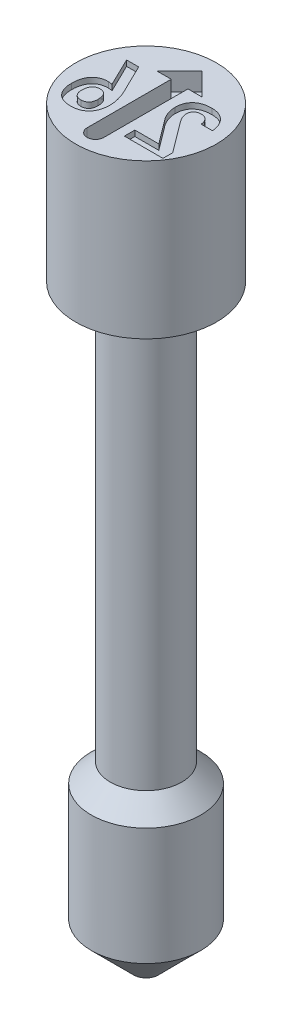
ISO-10303-21;
HEADER;
FILE_DESCRIPTION(('STEP AP214'),'2;1');
FILE_NAME('part.step','',(''),(''),'','','');
FILE_SCHEMA(('AUTOMOTIVE_DESIGN { 1 0 10303 214 1 1 1 1 }'));
ENDSEC;
DATA;
#1=APPLICATION_CONTEXT('core data for automotive mechanical design processes');
#2=APPLICATION_PROTOCOL_DEFINITION('international standard','automotive_design',2000,#1);
#3=PRODUCT_CONTEXT('',#1,'mechanical');
#4=PRODUCT('Part','Part','',(#3));
#5=PRODUCT_RELATED_PRODUCT_CATEGORY('part','',(#4));
#6=PRODUCT_DEFINITION_FORMATION('','',#4);
#7=PRODUCT_DEFINITION_CONTEXT('part definition',#1,'design');
#8=PRODUCT_DEFINITION('design','',#6,#7);
#9=PRODUCT_DEFINITION_SHAPE('','',#8);
#10=(LENGTH_UNIT() NAMED_UNIT(*) SI_UNIT(.MILLI.,.METRE.));
#11=(NAMED_UNIT(*) PLANE_ANGLE_UNIT() SI_UNIT($,.RADIAN.));
#12=(NAMED_UNIT(*) SI_UNIT($,.STERADIAN.) SOLID_ANGLE_UNIT());
#13=UNCERTAINTY_MEASURE_WITH_UNIT(LENGTH_MEASURE(1.E-05),#10,'distance_accuracy_value','');
#14=(GEOMETRIC_REPRESENTATION_CONTEXT(3) GLOBAL_UNCERTAINTY_ASSIGNED_CONTEXT((#13)) GLOBAL_UNIT_ASSIGNED_CONTEXT((#10,
#11,#12)) REPRESENTATION_CONTEXT('',''));
#15=CARTESIAN_POINT('',(0.,0.,0.));
#16=DIRECTION('',(0.,0.,1.));
#17=DIRECTION('',(1.,0.,0.));
#18=AXIS2_PLACEMENT_3D('',#15,#16,#17);
#19=CARTESIAN_POINT('',(0.,17.018,0.));
#20=DIRECTION('',(0.,1.,0.));
#21=DIRECTION('',(0.,0.,1.));
#22=AXIS2_PLACEMENT_3D('',#19,#20,#21);
#23=PLANE('',#22);
#24=DIRECTION('',(1.,0.,0.));
#25=VECTOR('',#24,1.);
#26=CARTESIAN_POINT('',(0.396715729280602,17.018,0.889));
#27=LINE('',#26,#25);
#28=CARTESIAN_POINT('',(0.396715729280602,17.018,0.889));
#29=VERTEX_POINT('',#28);
#30=CARTESIAN_POINT('',(1.27344868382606,17.018,0.889));
#31=VERTEX_POINT('',#30);
#32=EDGE_CURVE('E52',#29,#31,#27,.T.);
#33=ORIENTED_EDGE('',*,*,#32,.F.);
#34=DIRECTION('',(0.,0.,1.));
#35=VECTOR('',#34,1.);
#36=CARTESIAN_POINT('',(0.396715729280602,17.018,0.651493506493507));
#37=LINE('',#36,#35);
#38=CARTESIAN_POINT('',(0.396715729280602,17.018,0.651493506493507));
#39=VERTEX_POINT('',#38);
#40=EDGE_CURVE('E315',#39,#29,#37,.T.);
#41=ORIENTED_EDGE('',*,*,#40,.F.);
#42=DIRECTION('',(-1.,0.,0.));
#43=VECTOR('',#42,1.);
#44=CARTESIAN_POINT('',(0.942547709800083,17.018,0.651493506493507));
#45=LINE('',#44,#43);
#46=CARTESIAN_POINT('',(0.942547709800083,17.018,0.651493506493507));
#47=VERTEX_POINT('',#46);
#48=EDGE_CURVE('E318',#47,#39,#45,.T.);
#49=ORIENTED_EDGE('',*,*,#48,.F.);
#50=DIRECTION('',(0.601464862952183,0.,0.798899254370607));
#51=VECTOR('',#50,1.);
#52=CARTESIAN_POINT('',(0.53649819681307,17.018,0.112155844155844));
#53=LINE('',#52,#51);
#54=CARTESIAN_POINT('',(0.53649819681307,17.018,0.112155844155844));
#55=VERTEX_POINT('',#54);
#56=EDGE_CURVE('E1384',#55,#47,#53,.T.);
#57=ORIENTED_EDGE('',*,*,#56,.F.);
#58=CARTESIAN_POINT('',(0.40506556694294,17.018,-0.254618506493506));
#59=CARTESIAN_POINT('',(0.405471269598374,17.018,-0.239027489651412));
#60=CARTESIAN_POINT('',(0.406286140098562,17.018,-0.207712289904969));
#61=CARTESIAN_POINT('',(0.413333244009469,17.018,-0.160595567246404));
#62=CARTESIAN_POINT('',(0.423509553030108,17.018,-0.112989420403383));
#63=CARTESIAN_POINT('',(0.438977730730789,17.018,-0.0655806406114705));
#64=CARTESIAN_POINT('',(0.457607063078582,17.018,-0.0186388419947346));
#65=CARTESIAN_POINT('',(0.480321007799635,17.018,0.0267661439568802));
#66=CARTESIAN_POINT('',(0.506242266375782,17.018,0.0707688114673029));
#67=CARTESIAN_POINT('',(0.526365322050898,17.018,0.0982951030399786));
#68=CARTESIAN_POINT('',(0.53649819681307,17.018,0.112155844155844));
#69=B_SPLINE_CURVE_WITH_KNOTS('',3,(#58,#59,#60,#61,#62,#63,#64,#65,#66,#67,#68),.UNSPECIFIED.,
.F.,.F.,(4,1,1,1,1,1,1,1,4),(0.,0.117962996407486,0.236933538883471,0.360005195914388,
0.486119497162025,0.613931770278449,0.742012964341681,0.870091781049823,1.),.UNSPECIFIED.);
#70=CARTESIAN_POINT('',(0.40506556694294,17.018,-0.254618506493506));
#71=VERTEX_POINT('',#70);
#72=EDGE_CURVE('E1379',#71,#55,#69,.T.);
#73=ORIENTED_EDGE('',*,*,#72,.F.);
#74=DIRECTION('',(0.,0.,1.));
#75=VECTOR('',#74,1.);
#76=CARTESIAN_POINT('',(0.40506556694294,17.018,-0.255546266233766));
#77=LINE('',#76,#75);
#78=CARTESIAN_POINT('',(0.40506556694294,17.018,-0.255546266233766));
#79=VERTEX_POINT('',#78);
#80=EDGE_CURVE('E1373',#79,#71,#77,.T.);
#81=ORIENTED_EDGE('',*,*,#80,.F.);
#82=CARTESIAN_POINT('',(0.843277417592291,17.018,-0.654792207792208));
#83=CARTESIAN_POINT('',(0.826254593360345,17.018,-0.654544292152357));
#84=CARTESIAN_POINT('',(0.793163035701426,17.018,-0.654062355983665));
#85=CARTESIAN_POINT('',(0.745110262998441,17.018,-0.648934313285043));
#86=CARTESIAN_POINT('',(0.699975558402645,17.018,-0.641058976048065));
#87=CARTESIAN_POINT('',(0.657797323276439,17.018,-0.629685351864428));
#88=CARTESIAN_POINT('',(0.618659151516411,17.018,-0.614810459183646));
#89=CARTESIAN_POINT('',(0.582524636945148,17.018,-0.596748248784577));
#90=CARTESIAN_POINT('',(0.54915805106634,17.018,-0.575762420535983));
#91=CARTESIAN_POINT('',(0.519054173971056,17.018,-0.55114141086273));
#92=CARTESIAN_POINT('',(0.492170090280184,17.018,-0.523673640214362));
#93=CARTESIAN_POINT('',(0.468649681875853,17.018,-0.493460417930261));
#94=CARTESIAN_POINT('',(0.449235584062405,17.018,-0.460240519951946));
#95=CARTESIAN_POINT('',(0.432539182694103,17.018,-0.424683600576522));
#96=CARTESIAN_POINT('',(0.420453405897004,17.018,-0.386017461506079));
#97=CARTESIAN_POINT('',(0.411356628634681,17.018,-0.344966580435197));
#98=CARTESIAN_POINT('',(0.40615060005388,17.018,-0.30113955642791));
#99=CARTESIAN_POINT('',(0.405433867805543,17.018,-0.2710223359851));
#100=CARTESIAN_POINT('',(0.40506556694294,17.018,-0.255546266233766));
#101=B_SPLINE_CURVE_WITH_KNOTS('',3,(#82,#83,#84,#85,#86,#87,#88,#89,#90,#91,#92,#93,#94,#95,
#96,#97,#98,#99,#100),.UNSPECIFIED.,.F.,.F.,(4,1,1,1,1,1,1,1,1,1,1,1,1,1,1,1,4),(0.,
0.0757177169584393,0.147191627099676,0.214761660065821,0.279410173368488,0.341256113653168,
0.400743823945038,0.458895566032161,0.516277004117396,0.573364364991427,0.629605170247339,
0.686164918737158,0.744246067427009,0.804009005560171,0.865999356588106,0.931142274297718,1.),.UNSPECIFIED.);
#102=CARTESIAN_POINT('',(0.843277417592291,17.018,-0.654792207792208));
#103=VERTEX_POINT('',#102);
#104=EDGE_CURVE('E1365',#103,#79,#101,.T.);
#105=ORIENTED_EDGE('',*,*,#104,.F.);
#106=CARTESIAN_POINT('',(1.29200387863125,17.018,-0.218435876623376));
#107=CARTESIAN_POINT('',(1.2900256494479,17.018,-0.235388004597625));
#108=CARTESIAN_POINT('',(1.28616451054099,17.018,-0.268475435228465));
#109=CARTESIAN_POINT('',(1.27566263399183,17.018,-0.316155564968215));
#110=CARTESIAN_POINT('',(1.26281303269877,17.018,-0.360994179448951));
#111=CARTESIAN_POINT('',(1.24671495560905,17.018,-0.402932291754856));
#112=CARTESIAN_POINT('',(1.22750418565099,17.018,-0.441909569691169));
#113=CARTESIAN_POINT('',(1.20560976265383,17.018,-0.478214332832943));
#114=CARTESIAN_POINT('',(1.17993884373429,17.018,-0.510974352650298));
#115=CARTESIAN_POINT('',(1.15192762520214,17.018,-0.541168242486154));
#116=CARTESIAN_POINT('',(1.12085782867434,17.018,-0.567705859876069));
#117=CARTESIAN_POINT('',(1.08763218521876,17.018,-0.591036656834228));
#118=CARTESIAN_POINT('',(1.05225761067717,17.018,-0.610955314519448));
#119=CARTESIAN_POINT('',(1.01461928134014,17.018,-0.627110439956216));
#120=CARTESIAN_POINT('',(0.974775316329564,17.018,-0.639408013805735));
#121=CARTESIAN_POINT('',(0.932884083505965,17.018,-0.64843092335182));
#122=CARTESIAN_POINT('',(0.888768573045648,17.018,-0.653693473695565));
#123=CARTESIAN_POINT('',(0.858650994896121,17.018,-0.654420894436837));
#124=CARTESIAN_POINT('',(0.843277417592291,17.018,-0.654792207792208));
#125=B_SPLINE_CURVE_WITH_KNOTS('',3,(#106,#107,#108,#109,#110,#111,#112,#113,#114,#115,#116,
#117,#118,#119,#120,#121,#122,#123,#124),.UNSPECIFIED.,.F.,.F.,(4,1,1,1,1,1,1,1,1,1,1,1,1,1,1,1,
4),(0.,0.0735286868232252,0.143514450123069,0.210169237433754,0.274454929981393,
0.336856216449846,0.397291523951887,0.456843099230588,0.515945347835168,0.574554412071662,
0.632618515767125,0.690713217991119,0.749236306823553,0.808827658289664,0.870185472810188,
0.933735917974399,1.),.UNSPECIFIED.);
#126=CARTESIAN_POINT('',(1.29200387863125,17.018,-0.218435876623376));
#127=VERTEX_POINT('',#126);
#128=EDGE_CURVE('E1360',#127,#103,#125,.T.);
#129=ORIENTED_EDGE('',*,*,#128,.F.);
#130=DIRECTION('',(0.,0.,-1.));
#131=VECTOR('',#130,1.);
#132=CARTESIAN_POINT('',(1.29200387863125,17.018,-0.217508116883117));
#133=LINE('',#132,#131);
#134=CARTESIAN_POINT('',(1.29200387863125,17.018,-0.217508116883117));
#135=VERTEX_POINT('',#134);
#136=EDGE_CURVE('E1357',#135,#127,#133,.T.);
#137=ORIENTED_EDGE('',*,*,#136,.F.);
#138=DIRECTION('',(1.,0.,0.));
#139=VECTOR('',#138,1.);
#140=CARTESIAN_POINT('',(1.03532368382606,17.018,-0.217508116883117));
#141=LINE('',#140,#139);
#142=CARTESIAN_POINT('',(1.03532368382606,17.018,-0.217508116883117));
#143=VERTEX_POINT('',#142);
#144=EDGE_CURVE('E1354',#143,#135,#141,.T.);
#145=ORIENTED_EDGE('',*,*,#144,.F.);
#146=DIRECTION('',(0.,0.,1.));
#147=VECTOR('',#146,1.);
#148=CARTESIAN_POINT('',(1.03532368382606,17.018,-0.218435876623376));
#149=LINE('',#148,#147);
#150=CARTESIAN_POINT('',(1.03532368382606,17.018,-0.218435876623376));
#151=VERTEX_POINT('',#150);
#152=EDGE_CURVE('E1348',#151,#143,#149,.T.);
#153=ORIENTED_EDGE('',*,*,#152,.F.);
#154=CARTESIAN_POINT('',(0.841112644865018,17.018,-0.417285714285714));
#155=CARTESIAN_POINT('',(0.853973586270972,17.018,-0.416806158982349));
#156=CARTESIAN_POINT('',(0.878876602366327,17.018,-0.415877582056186));
#157=CARTESIAN_POINT('',(0.914224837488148,17.018,-0.405385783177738));
#158=CARTESIAN_POINT('',(0.946271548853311,17.018,-0.38926573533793));
#159=CARTESIAN_POINT('',(0.973885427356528,17.018,-0.365972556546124));
#160=CARTESIAN_POINT('',(0.997094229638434,17.018,-0.336937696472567));
#161=CARTESIAN_POINT('',(1.01549232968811,17.018,-0.302387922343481));
#162=CARTESIAN_POINT('',(1.0283730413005,17.018,-0.262224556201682));
#163=CARTESIAN_POINT('',(1.03293790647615,17.018,-0.233466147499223));
#164=CARTESIAN_POINT('',(1.03532368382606,17.018,-0.218435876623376));
#165=B_SPLINE_CURVE_WITH_KNOTS('',3,(#154,#155,#156,#157,#158,#159,#160,#161,#162,#163,#164),
.UNSPECIFIED.,.F.,.F.,(4,1,1,1,1,1,1,1,4),(0.,0.124986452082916,0.242014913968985,
0.3561482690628,0.472436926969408,0.591058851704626,0.716468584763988,0.851815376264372,1.),.UNSPECIFIED.);
#166=CARTESIAN_POINT('',(0.841112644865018,17.018,-0.417285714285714));
#167=VERTEX_POINT('',#166);
#168=EDGE_CURVE('E1340',#167,#151,#165,.T.);
#169=ORIENTED_EDGE('',*,*,#168,.F.);
#170=CARTESIAN_POINT('',(0.662673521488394,17.018,-0.255546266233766));
#171=CARTESIAN_POINT('',(0.663090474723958,17.018,-0.267776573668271));
#172=CARTESIAN_POINT('',(0.663887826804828,17.018,-0.29116495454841));
#173=CARTESIAN_POINT('',(0.673136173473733,17.018,-0.323903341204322));
#174=CARTESIAN_POINT('',(0.687836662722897,17.018,-0.352389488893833));
#175=CARTESIAN_POINT('',(0.708798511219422,17.018,-0.375960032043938));
#176=CARTESIAN_POINT('',(0.734878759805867,17.018,-0.39471716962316));
#177=CARTESIAN_POINT('',(0.766038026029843,17.018,-0.40825039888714));
#178=CARTESIAN_POINT('',(0.802108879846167,17.018,-0.415707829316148));
#179=CARTESIAN_POINT('',(0.827677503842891,17.018,-0.416742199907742));
#180=CARTESIAN_POINT('',(0.841112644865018,17.018,-0.417285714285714));
#181=B_SPLINE_CURVE_WITH_KNOTS('',3,(#170,#171,#172,#173,#174,#175,#176,#177,#178,#179,#180),
.UNSPECIFIED.,.F.,.F.,(4,1,1,1,1,1,1,1,4),(0.,0.133827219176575,0.255921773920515,
0.369738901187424,0.482715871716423,0.598532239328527,0.719553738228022,0.852638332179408,1.),.UNSPECIFIED.);
#182=CARTESIAN_POINT('',(0.662673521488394,17.018,-0.255546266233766));
#183=VERTEX_POINT('',#182);
#184=EDGE_CURVE('E1335',#183,#167,#181,.T.);
#185=ORIENTED_EDGE('',*,*,#184,.F.);
#186=DIRECTION('',(0.,0.,-1.));
#187=VECTOR('',#186,1.);
#188=CARTESIAN_POINT('',(0.662673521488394,17.018,-0.253381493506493));
#189=LINE('',#188,#187);
#190=CARTESIAN_POINT('',(0.662673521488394,17.018,-0.253381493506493));
#191=VERTEX_POINT('',#190);
#192=EDGE_CURVE('E1329',#191,#183,#189,.T.);
#193=ORIENTED_EDGE('',*,*,#192,.F.);
#194=CARTESIAN_POINT('',(0.748336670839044,17.018,-0.034739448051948));
#195=CARTESIAN_POINT('',(0.741838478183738,17.018,-0.0437367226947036));
#196=CARTESIAN_POINT('',(0.729024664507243,17.018,-0.0614784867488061));
#197=CARTESIAN_POINT('',(0.711877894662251,17.018,-0.0890630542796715));
#198=CARTESIAN_POINT('',(0.697433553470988,17.018,-0.117291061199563));
#199=CARTESIAN_POINT('',(0.684977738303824,17.018,-0.14564105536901));
#200=CARTESIAN_POINT('',(0.675221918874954,17.018,-0.17378390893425));
#201=CARTESIAN_POINT('',(0.667851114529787,17.018,-0.201124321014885));
#202=CARTESIAN_POINT('',(0.663785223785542,17.018,-0.227592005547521));
#203=CARTESIAN_POINT('',(0.663038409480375,17.018,-0.244916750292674));
#204=CARTESIAN_POINT('',(0.662673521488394,17.018,-0.253381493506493));
#205=B_SPLINE_CURVE_WITH_KNOTS('',3,(#194,#195,#196,#197,#198,#199,#200,#201,#202,#203,#204),
.UNSPECIFIED.,.F.,.F.,(4,1,1,1,1,1,1,1,4),(0.,0.139527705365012,0.275135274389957,
0.407888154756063,0.537917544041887,0.66417107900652,0.782063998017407,0.893518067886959,1.),.UNSPECIFIED.);
#206=CARTESIAN_POINT('',(0.748336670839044,17.018,-0.034739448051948));
#207=VERTEX_POINT('',#206);
#208=EDGE_CURVE('E1324',#207,#191,#205,.T.);
#209=ORIENTED_EDGE('',*,*,#208,.F.);
#210=DIRECTION('',(-0.597969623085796,0.,-0.801518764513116));
#211=VECTOR('',#210,1.);
#212=CARTESIAN_POINT('',(1.27344868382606,17.018,0.669120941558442));
#213=LINE('',#212,#211);
#214=CARTESIAN_POINT('',(1.27344868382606,17.018,0.669120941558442));
#215=VERTEX_POINT('',#214);
#216=EDGE_CURVE('E1321',#215,#207,#213,.T.);
#217=ORIENTED_EDGE('',*,*,#216,.F.);
#218=DIRECTION('',(0.,0.,-1.));
#219=VECTOR('',#218,1.);
#220=CARTESIAN_POINT('',(1.27344868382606,17.018,0.889));
#221=LINE('',#220,#219);
#222=EDGE_CURVE('E1319',#31,#215,#221,.T.);
#223=ORIENTED_EDGE('',*,*,#222,.F.);
#224=EDGE_LOOP('',(#33,#41,#49,#57,#73,#81,#105,#129,#137,#145,#153,#169,#185,#193,#209,#217,#223));
#225=FACE_BOUND('',#224,.T.);
#226=CARTESIAN_POINT('',(-1.24384800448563,17.018,0.44893262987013));
#227=CARTESIAN_POINT('',(-1.24349137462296,17.018,0.466677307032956));
#228=CARTESIAN_POINT('',(-1.24279721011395,17.018,0.501216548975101));
#229=CARTESIAN_POINT('',(-1.23743298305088,17.018,0.551456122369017));
#230=CARTESIAN_POINT('',(-1.228964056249,17.018,0.598683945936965));
#231=CARTESIAN_POINT('',(-1.21661166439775,17.018,0.642831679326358));
#232=CARTESIAN_POINT('',(-1.20049275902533,17.018,0.683844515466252));
#233=CARTESIAN_POINT('',(-1.18084833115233,17.018,0.721831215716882));
#234=CARTESIAN_POINT('',(-1.158083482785,17.018,0.757037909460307));
#235=CARTESIAN_POINT('',(-1.13127544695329,17.018,0.788611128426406));
#236=CARTESIAN_POINT('',(-1.10142030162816,17.018,0.816926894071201));
#237=CARTESIAN_POINT('',(-1.06858296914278,17.018,0.841870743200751));
#238=CARTESIAN_POINT('',(-1.0325450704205,17.018,0.862545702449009));
#239=CARTESIAN_POINT('',(-0.993603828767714,17.018,0.879401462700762));
#240=CARTESIAN_POINT('',(-0.951842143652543,17.018,0.892616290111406));
#241=CARTESIAN_POINT('',(-0.907026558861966,17.018,0.902241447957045));
#242=CARTESIAN_POINT('',(-0.859276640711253,17.018,0.907769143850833));
#243=CARTESIAN_POINT('',(-0.826473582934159,17.018,0.908445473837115));
#244=CARTESIAN_POINT('',(-0.809656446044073,17.018,0.908792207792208));
#245=B_SPLINE_CURVE_WITH_KNOTS('',3,(#226,#227,#228,#229,#230,#231,#232,#233,#234,#235,#236,
#237,#238,#239,#240,#241,#242,#243,#244),.UNSPECIFIED.,.F.,.F.,(4,1,1,1,1,1,1,1,1,1,1,1,1,1,1,1,
4),(0.,0.0739861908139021,0.144010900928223,0.210453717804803,0.273873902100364,
0.334863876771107,0.393890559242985,0.451957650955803,0.50931223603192,0.5661765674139,
0.62326632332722,0.680854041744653,0.738995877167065,0.7999039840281,0.863226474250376,
0.929880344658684,1.),.UNSPECIFIED.);
#246=CARTESIAN_POINT('',(-1.24384800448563,17.018,0.44893262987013));
#247=VERTEX_POINT('',#246);
#248=CARTESIAN_POINT('',(-0.809656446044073,17.018,0.908792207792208));
#249=VERTEX_POINT('',#248);
#250=EDGE_CURVE('E60',#247,#249,#245,.T.);
#251=ORIENTED_EDGE('',*,*,#250,.F.);
#252=DIRECTION('',(0.,0.,1.));
#253=VECTOR('',#252,1.);
#254=CARTESIAN_POINT('',(-1.24384800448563,17.018,0.44800487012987));
#255=LINE('',#254,#253);
#256=CARTESIAN_POINT('',(-1.24384800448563,17.018,0.44800487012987));
#257=VERTEX_POINT('',#256);
#258=EDGE_CURVE('E436',#257,#247,#255,.T.);
#259=ORIENTED_EDGE('',*,*,#258,.F.);
#260=CARTESIAN_POINT('',(-0.858827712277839,17.018,-0.00164935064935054));
#261=CARTESIAN_POINT('',(-0.873589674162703,17.018,-0.00131835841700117));
#262=CARTESIAN_POINT('',(-0.902500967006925,17.018,-0.000670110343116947));
#263=CARTESIAN_POINT('',(-0.94449606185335,17.018,0.00512541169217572));
#264=CARTESIAN_POINT('',(-0.984137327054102,17.018,0.0137362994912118));
#265=CARTESIAN_POINT('',(-1.0208694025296,17.018,0.0271359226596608));
#266=CARTESIAN_POINT('',(-1.05551445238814,17.018,0.0432335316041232));
#267=CARTESIAN_POINT('',(-1.08713137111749,17.018,0.0640224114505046));
#268=CARTESIAN_POINT('',(-1.11650570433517,17.018,0.0879314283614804));
#269=CARTESIAN_POINT('',(-1.14312131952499,17.018,0.115595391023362));
#270=CARTESIAN_POINT('',(-1.16696447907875,17.018,0.146607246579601));
#271=CARTESIAN_POINT('',(-1.18773090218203,17.018,0.180709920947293));
#272=CARTESIAN_POINT('',(-1.20508878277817,17.018,0.217880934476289));
#273=CARTESIAN_POINT('',(-1.21936818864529,17.018,0.258058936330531));
#274=CARTESIAN_POINT('',(-1.23032720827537,17.018,0.301358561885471));
#275=CARTESIAN_POINT('',(-1.23839313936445,17.018,0.347554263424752));
#276=CARTESIAN_POINT('',(-1.24301398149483,17.018,0.396780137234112));
#277=CARTESIAN_POINT('',(-1.24356419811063,17.018,0.430573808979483));
#278=CARTESIAN_POINT('',(-1.24384800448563,17.018,0.44800487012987));
#279=B_SPLINE_CURVE_WITH_KNOTS('',3,(#260,#261,#262,#263,#264,#265,#266,#267,#268,#269,#270,
#271,#272,#273,#274,#275,#276,#277,#278),.UNSPECIFIED.,.F.,.F.,(4,1,1,1,1,1,1,1,1,1,1,1,1,1,1,1,
4),(0.,0.0658754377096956,0.129017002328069,0.188974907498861,0.246623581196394,
0.303237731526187,0.359155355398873,0.415082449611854,0.472045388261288,0.530135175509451,
0.589416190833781,0.649949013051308,0.712984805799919,0.779517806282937,0.849133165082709,
0.922181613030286,1.),.UNSPECIFIED.);
#280=CARTESIAN_POINT('',(-0.858827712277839,17.018,-0.00164935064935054));
#281=VERTEX_POINT('',#280);
#282=EDGE_CURVE('E615',#281,#257,#279,.T.);
#283=ORIENTED_EDGE('',*,*,#282,.F.);
#284=CARTESIAN_POINT('',(-0.66554443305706,17.018,0.100713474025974));
#285=CARTESIAN_POINT('',(-0.67023014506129,17.018,0.0924927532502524));
#286=CARTESIAN_POINT('',(-0.679416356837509,17.018,0.0763762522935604));
#287=CARTESIAN_POINT('',(-0.697506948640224,17.018,0.055576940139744));
#288=CARTESIAN_POINT('',(-0.71768900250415,17.018,0.0375616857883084));
#289=CARTESIAN_POINT('',(-0.741013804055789,17.018,0.0232731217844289));
#290=CARTESIAN_POINT('',(-0.766866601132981,17.018,0.0121389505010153));
#291=CARTESIAN_POINT('',(-0.795257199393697,17.018,0.00418495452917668));
#292=CARTESIAN_POINT('',(-0.82617108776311,17.018,-0.000945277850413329));
#293=CARTESIAN_POINT('',(-0.84767284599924,17.018,-0.00140885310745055));
#294=CARTESIAN_POINT('',(-0.858827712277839,17.018,-0.00164935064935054));
#295=B_SPLINE_CURVE_WITH_KNOTS('',3,(#284,#285,#286,#287,#288,#289,#290,#291,#292,#293,#294),
.UNSPECIFIED.,.F.,.F.,(4,1,1,1,1,1,1,1,4),(0.,0.122662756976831,0.240477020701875,
0.356264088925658,0.472961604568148,0.594130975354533,0.720885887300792,0.855198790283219,1.),.UNSPECIFIED.);
#296=CARTESIAN_POINT('',(-0.760970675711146,17.018,0.0150033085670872));
#297=VERTEX_POINT('',#296);
#298=EDGE_CURVE('E620',#297,#281,#295,.T.);
#299=ORIENTED_EDGE('',*,*,#298,.F.);
#300=DIRECTION('',(0.438125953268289,0.,0.898913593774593));
#301=VECTOR('',#300,1.);
#302=CARTESIAN_POINT('',(-1.07777901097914,17.018,-0.635));
#303=LINE('',#302,#301);
#304=CARTESIAN_POINT('',(-1.07777901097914,17.018,-0.635));
#305=VERTEX_POINT('',#304);
#306=EDGE_CURVE('E628',#305,#297,#303,.T.);
#307=ORIENTED_EDGE('',*,*,#306,.F.);
#308=DIRECTION('',(-1.,0.,0.));
#309=VECTOR('',#308,1.);
#310=CARTESIAN_POINT('',(-0.801306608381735,17.018,-0.635));
#311=LINE('',#310,#309);
#312=CARTESIAN_POINT('',(-0.801306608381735,17.018,-0.635));
#313=VERTEX_POINT('',#312);
#314=EDGE_CURVE('E634',#313,#305,#311,.T.);
#315=ORIENTED_EDGE('',*,*,#314,.F.);
#316=DIRECTION('',(-0.436864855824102,0.,-0.899527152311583));
#317=VECTOR('',#316,1.);
#318=CARTESIAN_POINT('',(-0.481848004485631,17.018,0.0227816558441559));
#319=LINE('',#318,#317);
#320=CARTESIAN_POINT('',(-0.481848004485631,17.018,0.0227816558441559));
#321=VERTEX_POINT('',#320);
#322=EDGE_CURVE('E637',#321,#313,#319,.T.);
#323=ORIENTED_EDGE('',*,*,#322,.F.);
#324=CARTESIAN_POINT('',(-0.376392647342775,17.018,0.446458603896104));
#325=CARTESIAN_POINT('',(-0.376818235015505,17.018,0.429749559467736));
#326=CARTESIAN_POINT('',(-0.377684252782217,17.018,0.395748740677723));
#327=CARTESIAN_POINT('',(-0.38266045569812,17.018,0.344065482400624));
#328=CARTESIAN_POINT('',(-0.391544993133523,17.018,0.291038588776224));
#329=CARTESIAN_POINT('',(-0.403423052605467,17.018,0.236887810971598));
#330=CARTESIAN_POINT('',(-0.419074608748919,17.018,0.182524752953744));
#331=CARTESIAN_POINT('',(-0.436766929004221,17.018,0.12828633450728));
#332=CARTESIAN_POINT('',(-0.457958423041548,17.018,0.0750416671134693));
#333=CARTESIAN_POINT('',(-0.473866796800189,17.018,0.0402410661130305));
#334=CARTESIAN_POINT('',(-0.481848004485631,17.018,0.0227816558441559));
#335=B_SPLINE_CURVE_WITH_KNOTS('',3,(#324,#325,#326,#327,#328,#329,#330,#331,#332,#333,#334),
.UNSPECIFIED.,.F.,.F.,(4,1,1,1,1,1,1,1,4),(0.,0.1139317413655,0.231836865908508,
0.353616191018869,0.480309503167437,0.609573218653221,0.73914226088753,0.869128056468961,1.),.UNSPECIFIED.);
#336=CARTESIAN_POINT('',(-0.376392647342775,17.018,0.446458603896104));
#337=VERTEX_POINT('',#336);
#338=EDGE_CURVE('E640',#337,#321,#335,.T.);
#339=ORIENTED_EDGE('',*,*,#338,.F.);
#340=DIRECTION('',(0.,0.,-1.));
#341=VECTOR('',#340,1.);
#342=CARTESIAN_POINT('',(-0.376392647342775,17.018,0.447386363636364));
#343=LINE('',#342,#341);
#344=CARTESIAN_POINT('',(-0.376392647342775,17.018,0.447386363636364));
#345=VERTEX_POINT('',#344);
#346=EDGE_CURVE('E645',#345,#337,#343,.T.);
#347=ORIENTED_EDGE('',*,*,#346,.F.);
#348=CARTESIAN_POINT('',(-0.809656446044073,17.018,0.908792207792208));
#349=CARTESIAN_POINT('',(-0.792941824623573,17.018,0.908450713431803));
#350=CARTESIAN_POINT('',(-0.760445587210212,17.018,0.907786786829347));
#351=CARTESIAN_POINT('',(-0.713110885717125,17.018,0.902215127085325));
#352=CARTESIAN_POINT('',(-0.668708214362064,17.018,0.892606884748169));
#353=CARTESIAN_POINT('',(-0.62710273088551,17.018,0.879402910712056));
#354=CARTESIAN_POINT('',(-0.588428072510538,17.018,0.862275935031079));
#355=CARTESIAN_POINT('',(-0.552630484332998,17.018,0.841450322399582));
#356=CARTESIAN_POINT('',(-0.519550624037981,17.018,0.816857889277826));
#357=CARTESIAN_POINT('',(-0.489553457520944,17.018,0.788399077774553));
#358=CARTESIAN_POINT('',(-0.463027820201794,17.018,0.756376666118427));
#359=CARTESIAN_POINT('',(-0.439454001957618,17.018,0.721538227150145));
#360=CARTESIAN_POINT('',(-0.420110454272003,17.018,0.683184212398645));
#361=CARTESIAN_POINT('',(-0.403959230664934,17.018,0.64199904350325));
#362=CARTESIAN_POINT('',(-0.391635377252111,17.018,0.597624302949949));
#363=CARTESIAN_POINT('',(-0.382731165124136,17.018,0.550355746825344));
#364=CARTESIAN_POINT('',(-0.377456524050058,17.018,0.49987232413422));
#365=CARTESIAN_POINT('',(-0.376754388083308,17.018,0.465232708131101));
#366=CARTESIAN_POINT('',(-0.376392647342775,17.018,0.447386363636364));
#367=B_SPLINE_CURVE_WITH_KNOTS('',3,(#348,#349,#350,#351,#352,#353,#354,#355,#356,#357,#358,
#359,#360,#361,#362,#363,#364,#365,#366),.UNSPECIFIED.,.F.,.F.,(4,1,1,1,1,1,1,1,1,1,1,1,1,1,1,1,
4),(0.,0.0696928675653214,0.13549549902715,0.198400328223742,0.258901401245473,
0.317218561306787,0.374436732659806,0.431270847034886,0.488745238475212,0.546431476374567,
0.604379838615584,0.663791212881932,0.725183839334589,0.788606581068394,0.855553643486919,
0.925581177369,1.),.UNSPECIFIED.);
#368=EDGE_CURVE('E651',#249,#345,#367,.T.);
#369=ORIENTED_EDGE('',*,*,#368,.F.);
#370=EDGE_LOOP('',(#251,#259,#283,#299,#307,#315,#323,#339,#347,#369));
#371=FACE_BOUND('',#370,.T.);
#372=CARTESIAN_POINT('',(0.,17.018,1.14915906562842));
#373=DIRECTION('',(0.,1.,0.));
#374=DIRECTION('',(0.,0.,1.));
#375=AXIS2_PLACEMENT_3D('',#372,#373,#374);
#376=CIRCLE('',#375,0.1905);
#377=CARTESIAN_POINT('',(-0.1905,17.018,1.14915906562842));
#378=VERTEX_POINT('',#377);
#379=CARTESIAN_POINT('',(0.1905,17.018,1.14915906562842));
#380=VERTEX_POINT('',#379);
#381=EDGE_CURVE('E570',#378,#380,#376,.T.);
#382=ORIENTED_EDGE('',*,*,#381,.F.);
#383=DIRECTION('',(0.,0.,1.));
#384=VECTOR('',#383,1.);
#385=CARTESIAN_POINT('',(-0.1905,17.018,1.14915906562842));
#386=LINE('',#385,#384);
#387=CARTESIAN_POINT('',(-0.1905,17.018,-0.762));
#388=VERTEX_POINT('',#387);
#389=EDGE_CURVE('E551',#388,#378,#386,.T.);
#390=ORIENTED_EDGE('',*,*,#389,.F.);
#391=DIRECTION('',(1.,0.,0.));
#392=VECTOR('',#391,1.);
#393=CARTESIAN_POINT('',(-0.1905,17.018,-0.762));
#394=LINE('',#393,#392);
#395=CARTESIAN_POINT('',(-0.508,17.018,-0.762));
#396=VERTEX_POINT('',#395);
#397=EDGE_CURVE('E555',#396,#388,#394,.T.);
#398=ORIENTED_EDGE('',*,*,#397,.F.);
#399=DIRECTION('',(-0.707106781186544,0.,0.707106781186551));
#400=VECTOR('',#399,1.);
#401=CARTESIAN_POINT('',(0.,17.018,-1.27000000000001));
#402=LINE('',#401,#400);
#403=CARTESIAN_POINT('',(0.,17.018,-1.27000000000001));
#404=VERTEX_POINT('',#403);
#405=EDGE_CURVE('E558',#404,#396,#402,.T.);
#406=ORIENTED_EDGE('',*,*,#405,.F.);
#407=DIRECTION('',(-0.707106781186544,0.,-0.707106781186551));
#408=VECTOR('',#407,1.);
#409=CARTESIAN_POINT('',(0.508,17.018,-0.762));
#410=LINE('',#409,#408);
#411=CARTESIAN_POINT('',(0.508,17.018,-0.762));
#412=VERTEX_POINT('',#411);
#413=EDGE_CURVE('E561',#412,#404,#410,.T.);
#414=ORIENTED_EDGE('',*,*,#413,.F.);
#415=DIRECTION('',(1.,0.,0.));
#416=VECTOR('',#415,1.);
#417=CARTESIAN_POINT('',(0.1905,17.018,-0.762));
#418=LINE('',#417,#416);
#419=CARTESIAN_POINT('',(0.1905,17.018,-0.762));
#420=VERTEX_POINT('',#419);
#421=EDGE_CURVE('E564',#420,#412,#418,.T.);
#422=ORIENTED_EDGE('',*,*,#421,.F.);
#423=DIRECTION('',(0.,0.,-1.));
#424=VECTOR('',#423,1.);
#425=CARTESIAN_POINT('',(0.1905,17.018,1.14915906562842));
#426=LINE('',#425,#424);
#427=EDGE_CURVE('E567',#380,#420,#426,.T.);
#428=ORIENTED_EDGE('',*,*,#427,.F.);
#429=EDGE_LOOP('',(#382,#390,#398,#406,#414,#422,#428));
#430=FACE_BOUND('',#429,.T.);
#431=CARTESIAN_POINT('',(0.,17.018,0.));
#432=DIRECTION('',(0.,-1.,0.));
#433=DIRECTION('',(0.,0.,-1.));
#434=AXIS2_PLACEMENT_3D('',#431,#432,#433);
#435=CIRCLE('',#434,1.6002);
#436=CARTESIAN_POINT('',(0.,17.018,-1.6002));
#437=VERTEX_POINT('',#436);
#438=EDGE_CURVE('E11',#437,#437,#435,.T.);
#439=ORIENTED_EDGE('',*,*,#438,.F.);
#440=EDGE_LOOP('',(#439));
#441=FACE_BOUND('',#440,.T.);
#442=ADVANCED_FACE('F37',(#225,#371,#430,#441),#23,.T.);
#443=CARTESIAN_POINT('',(0.,0.,0.));
#444=DIRECTION('',(0.,-1.,0.));
#445=DIRECTION('',(0.,0.,-1.));
#446=AXIS2_PLACEMENT_3D('',#443,#444,#445);
#447=CYLINDRICAL_SURFACE('',#446,1.6002);
#448=ORIENTED_EDGE('',*,*,#438,.T.);
#449=EDGE_LOOP('',(#448));
#450=FACE_BOUND('',#449,.T.);
#451=CARTESIAN_POINT('',(0.,13.5128,0.));
#452=DIRECTION('',(0.,-1.,0.));
#453=DIRECTION('',(0.,0.,-1.));
#454=AXIS2_PLACEMENT_3D('',#451,#452,#453);
#455=CIRCLE('',#454,1.6002);
#456=CARTESIAN_POINT('',(0.,13.5128,-1.6002));
#457=VERTEX_POINT('',#456);
#458=EDGE_CURVE('E45',#457,#457,#455,.T.);
#459=ORIENTED_EDGE('',*,*,#458,.F.);
#460=EDGE_LOOP('',(#459));
#461=FACE_BOUND('',#460,.T.);
#462=ADVANCED_FACE('F507',(#450,#461),#447,.T.);
#463=CARTESIAN_POINT('',(1.6002,13.5128,0.));
#464=DIRECTION('',(0.,-1.,0.));
#465=DIRECTION('',(0.,0.,-1.));
#466=AXIS2_PLACEMENT_3D('',#463,#464,#465);
#467=PLANE('',#466);
#468=ORIENTED_EDGE('',*,*,#458,.T.);
#469=EDGE_LOOP('',(#468));
#470=FACE_BOUND('',#469,.T.);
#471=CARTESIAN_POINT('',(0.,13.5128,0.));
#472=DIRECTION('',(0.,-1.,0.));
#473=DIRECTION('',(0.,0.,-1.));
#474=AXIS2_PLACEMENT_3D('',#471,#472,#473);
#475=CIRCLE('',#474,0.812799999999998);
#476=CARTESIAN_POINT('',(0.,13.5128,-0.812799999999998));
#477=VERTEX_POINT('',#476);
#478=EDGE_CURVE('E519',#477,#477,#475,.T.);
#479=ORIENTED_EDGE('',*,*,#478,.F.);
#480=EDGE_LOOP('',(#479));
#481=FACE_BOUND('',#480,.T.);
#482=ADVANCED_FACE('F504',(#470,#481),#467,.T.);
#483=CARTESIAN_POINT('',(0.,0.,0.));
#484=DIRECTION('',(0.,-1.,0.));
#485=DIRECTION('',(0.,0.,-1.));
#486=AXIS2_PLACEMENT_3D('',#483,#484,#485);
#487=CYLINDRICAL_SURFACE('',#486,0.812799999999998);
#488=ORIENTED_EDGE('',*,*,#478,.T.);
#489=EDGE_LOOP('',(#488));
#490=FACE_BOUND('',#489,.T.);
#491=CARTESIAN_POINT('',(0.,4.064,0.));
#492=DIRECTION('',(0.,-1.,0.));
#493=DIRECTION('',(0.,0.,-1.));
#494=AXIS2_PLACEMENT_3D('',#491,#492,#493);
#495=CIRCLE('',#494,0.812799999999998);
#496=CARTESIAN_POINT('',(0.,4.064,-0.812799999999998));
#497=VERTEX_POINT('',#496);
#498=EDGE_CURVE('E521',#497,#497,#495,.T.);
#499=ORIENTED_EDGE('',*,*,#498,.F.);
#500=EDGE_LOOP('',(#499));
#501=FACE_BOUND('',#500,.T.);
#502=ADVANCED_FACE('F500',(#490,#501),#487,.T.);
#503=CARTESIAN_POINT('',(0.,3.63220000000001,0.));
#504=DIRECTION('',(0.,-1.,0.));
#505=DIRECTION('',(0.,0.,-1.));
#506=AXIS2_PLACEMENT_3D('',#503,#504,#505);
#507=CONICAL_SURFACE('',#506,1.2446,0.785398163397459);
#508=ORIENTED_EDGE('',*,*,#498,.T.);
#509=EDGE_LOOP('',(#508));
#510=FACE_BOUND('',#509,.T.);
#511=CARTESIAN_POINT('',(0.,3.63220000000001,0.));
#512=DIRECTION('',(0.,-1.,0.));
#513=DIRECTION('',(0.,0.,-1.));
#514=AXIS2_PLACEMENT_3D('',#511,#512,#513);
#515=CIRCLE('',#514,1.2446);
#516=CARTESIAN_POINT('',(0.,3.63220000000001,-1.2446));
#517=VERTEX_POINT('',#516);
#518=EDGE_CURVE('E526',#517,#517,#515,.T.);
#519=ORIENTED_EDGE('',*,*,#518,.F.);
#520=EDGE_LOOP('',(#519));
#521=FACE_BOUND('',#520,.T.);
#522=ADVANCED_FACE('F496',(#510,#521),#507,.T.);
#523=CARTESIAN_POINT('',(0.,0.,0.));
#524=DIRECTION('',(0.,-1.,0.));
#525=DIRECTION('',(0.,0.,-1.));
#526=AXIS2_PLACEMENT_3D('',#523,#524,#525);
#527=CYLINDRICAL_SURFACE('',#526,1.2446);
#528=ORIENTED_EDGE('',*,*,#518,.T.);
#529=EDGE_LOOP('',(#528));
#530=FACE_BOUND('',#529,.T.);
#531=CARTESIAN_POINT('',(0.,0.9652,0.));
#532=DIRECTION('',(0.,-1.,0.));
#533=DIRECTION('',(0.,0.,-1.));
#534=AXIS2_PLACEMENT_3D('',#531,#532,#533);
#535=CIRCLE('',#534,1.2446);
#536=CARTESIAN_POINT('',(0.,0.9652,1.2446));
#537=VERTEX_POINT('',#536);
#538=EDGE_CURVE('E529',#537,#537,#535,.T.);
#539=ORIENTED_EDGE('',*,*,#538,.F.);
#540=EDGE_LOOP('',(#539));
#541=FACE_BOUND('',#540,.T.);
#542=ADVANCED_FACE('F492',(#530,#541),#527,.T.);
#543=CARTESIAN_POINT('',(0.,0.,0.));
#544=DIRECTION('',(0.,1.,0.));
#545=DIRECTION('',(0.,0.,1.));
#546=AXIS2_PLACEMENT_3D('',#543,#544,#545);
#547=CONICAL_SURFACE('',#546,0.279400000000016,0.78539816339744);
#548=CARTESIAN_POINT('',(0.,0.,0.));
#549=DIRECTION('',(0.,-1.,0.));
#550=DIRECTION('',(0.,0.,-1.));
#551=AXIS2_PLACEMENT_3D('',#548,#549,#550);
#552=CIRCLE('',#551,0.279400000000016);
#553=CARTESIAN_POINT('',(0.,0.,0.279400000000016));
#554=VERTEX_POINT('',#553);
#555=EDGE_CURVE('E532',#554,#554,#552,.T.);
#556=CARTESIAN_POINT('',(0.,0.9652,1.2446));
#557=CARTESIAN_POINT('',(0.,0.955145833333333,1.23454583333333));
#558=CARTESIAN_POINT('',(0.,0.945091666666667,1.22449166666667));
#559=CARTESIAN_POINT('',(0.,0.924983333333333,1.20438333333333));
#560=CARTESIAN_POINT('',(0.,0.914929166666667,1.19432916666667));
#561=CARTESIAN_POINT('',(0.,0.894820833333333,1.17422083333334));
#562=CARTESIAN_POINT('',(0.,0.884766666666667,1.16416666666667));
#563=CARTESIAN_POINT('',(0.,0.864658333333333,1.14405833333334));
#564=CARTESIAN_POINT('',(0.,0.854604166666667,1.13400416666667));
#565=CARTESIAN_POINT('',(0.,0.834495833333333,1.11389583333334));
#566=CARTESIAN_POINT('',(0.,0.824441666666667,1.10384166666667));
#567=CARTESIAN_POINT('',(0.,0.804333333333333,1.08373333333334));
#568=CARTESIAN_POINT('',(0.,0.794279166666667,1.07367916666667));
#569=CARTESIAN_POINT('',(0.,0.774170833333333,1.05357083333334));
#570=CARTESIAN_POINT('',(0.,0.764116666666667,1.04351666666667));
#571=CARTESIAN_POINT('',(0.,0.744008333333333,1.02340833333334));
#572=CARTESIAN_POINT('',(0.,0.733954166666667,1.01335416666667));
#573=CARTESIAN_POINT('',(0.,0.713845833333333,0.993245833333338));
#574=CARTESIAN_POINT('',(0.,0.703791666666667,0.983191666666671));
#575=CARTESIAN_POINT('',(0.,0.683683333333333,0.963083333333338));
#576=CARTESIAN_POINT('',(0.,0.673629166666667,0.953029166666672));
#577=CARTESIAN_POINT('',(0.,0.653520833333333,0.932920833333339));
#578=CARTESIAN_POINT('',(0.,0.643466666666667,0.922866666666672));
#579=CARTESIAN_POINT('',(0.,0.623358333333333,0.902758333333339));
#580=CARTESIAN_POINT('',(0.,0.613304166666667,0.892704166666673));
#581=CARTESIAN_POINT('',(0.,0.593195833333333,0.87259583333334));
#582=CARTESIAN_POINT('',(0.,0.583141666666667,0.862541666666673));
#583=CARTESIAN_POINT('',(0.,0.563033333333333,0.84243333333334));
#584=CARTESIAN_POINT('',(0.,0.552979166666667,0.832379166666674));
#585=CARTESIAN_POINT('',(0.,0.532870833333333,0.812270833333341));
#586=CARTESIAN_POINT('',(0.,0.522816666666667,0.802216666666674));
#587=CARTESIAN_POINT('',(0.,0.502708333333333,0.782108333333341));
#588=CARTESIAN_POINT('',(0.,0.492654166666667,0.772054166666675));
#589=CARTESIAN_POINT('',(0.,0.472545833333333,0.751945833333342));
#590=CARTESIAN_POINT('',(0.,0.462491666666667,0.741891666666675));
#591=CARTESIAN_POINT('',(0.,0.442383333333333,0.721783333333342));
#592=CARTESIAN_POINT('',(0.,0.432329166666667,0.711729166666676));
#593=CARTESIAN_POINT('',(0.,0.412220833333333,0.691620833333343));
#594=CARTESIAN_POINT('',(0.,0.402166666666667,0.681566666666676));
#595=CARTESIAN_POINT('',(0.,0.382058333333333,0.661458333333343));
#596=CARTESIAN_POINT('',(0.,0.372004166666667,0.651404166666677));
#597=CARTESIAN_POINT('',(0.,0.351895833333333,0.631295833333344));
#598=CARTESIAN_POINT('',(0.,0.341841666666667,0.621241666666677));
#599=CARTESIAN_POINT('',(0.,0.321733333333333,0.601133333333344));
#600=CARTESIAN_POINT('',(0.,0.311679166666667,0.591079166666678));
#601=CARTESIAN_POINT('',(0.,0.291570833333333,0.570970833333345));
#602=CARTESIAN_POINT('',(0.,0.281516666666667,0.560916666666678));
#603=CARTESIAN_POINT('',(0.,0.261408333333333,0.540808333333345));
#604=CARTESIAN_POINT('',(0.,0.251354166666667,0.530754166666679));
#605=CARTESIAN_POINT('',(0.,0.231245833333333,0.510645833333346));
#606=CARTESIAN_POINT('',(0.,0.221191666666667,0.500591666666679));
#607=CARTESIAN_POINT('',(0.,0.201083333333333,0.480483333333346));
#608=CARTESIAN_POINT('',(0.,0.191029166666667,0.47042916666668));
#609=CARTESIAN_POINT('',(0.,0.170920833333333,0.450320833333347));
#610=CARTESIAN_POINT('',(0.,0.160866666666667,0.44026666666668));
#611=CARTESIAN_POINT('',(0.,0.140758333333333,0.420158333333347));
#612=CARTESIAN_POINT('',(0.,0.130704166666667,0.410104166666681));
#613=CARTESIAN_POINT('',(0.,0.110595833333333,0.389995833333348));
#614=CARTESIAN_POINT('',(0.,0.100541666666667,0.379941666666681));
#615=CARTESIAN_POINT('',(0.,0.0804333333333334,0.359833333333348));
#616=CARTESIAN_POINT('',(0.,0.0703791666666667,0.349779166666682));
#617=CARTESIAN_POINT('',(0.,0.0502708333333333,0.329670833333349));
#618=CARTESIAN_POINT('',(0.,0.0402166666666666,0.319616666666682));
#619=CARTESIAN_POINT('',(0.,0.0201083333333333,0.299508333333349));
#620=CARTESIAN_POINT('',(0.,0.0100541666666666,0.289454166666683));
#621=CARTESIAN_POINT('',(0.,0.,0.279400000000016));
#622=B_SPLINE_CURVE_WITH_KNOTS('',3,(#556,#557,#558,#559,#560,#561,#562,#563,#564,#565,#566,
#567,#568,#569,#570,#571,#572,#573,#574,#575,#576,#577,#578,#579,#580,#581,#582,#583,#584,#585,
#586,#587,#588,#589,#590,#591,#592,#593,#594,#595,#596,#597,#598,#599,#600,#601,#602,#603,#604,
#605,#606,#607,#608,#609,#610,#611,#612,#613,#614,#615,#616,#617,#618,#619,#620,#621),
.UNSPECIFIED.,.F.,.F.,(4,2,2,2,2,2,2,2,2,2,2,2,2,2,2,2,2,2,2,2,2,2,2,2,2,2,2,2,2,2,2,2,4),(0.,
0.0426562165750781,0.0853124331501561,0.127968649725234,0.170624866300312,0.21328108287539,
0.255937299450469,0.298593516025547,0.341249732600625,0.383905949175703,0.426562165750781,
0.469218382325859,0.511874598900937,0.554530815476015,0.597187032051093,0.639843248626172,
0.68249946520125,0.725155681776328,0.767811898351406,0.810468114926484,0.853124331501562,
0.895780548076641,0.938436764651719,0.981092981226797,1.02374919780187,1.06640541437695,
1.10906163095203,1.15171784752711,1.19437406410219,1.23703028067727,1.27968649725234,
1.32234271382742,1.3649989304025),.UNSPECIFIED.);
#623=EDGE_CURVE('BSEAM488',#537,#554,#622,.T.);
#624=ORIENTED_EDGE('',*,*,#538,.T.);
#625=ORIENTED_EDGE('',*,*,#555,.F.);
#626=ORIENTED_EDGE('',*,*,#623,.T.);
#627=ORIENTED_EDGE('',*,*,#623,.F.);
#628=EDGE_LOOP('',(#624,#626,#625,#627));
#629=FACE_BOUND('',#628,.T.);
#630=ADVANCED_FACE('F488',(#629),#547,.T.);
#631=CARTESIAN_POINT('',(0.279400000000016,0.,0.));
#632=DIRECTION('',(0.,-1.,0.));
#633=DIRECTION('',(0.,0.,-1.));
#634=AXIS2_PLACEMENT_3D('',#631,#632,#633);
#635=PLANE('',#634);
#636=ORIENTED_EDGE('',*,*,#555,.T.);
#637=EDGE_LOOP('',(#636));
#638=FACE_BOUND('',#637,.T.);
#639=ADVANCED_FACE('F484',(#638),#635,.T.);
#640=CARTESIAN_POINT('',(0.,16.6116,1.14915906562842));
#641=DIRECTION('',(0.,1.,0.));
#642=DIRECTION('',(0.,0.,1.));
#643=AXIS2_PLACEMENT_3D('',#640,#641,#642);
#644=CYLINDRICAL_SURFACE('',#643,0.1905);
#645=ORIENTED_EDGE('',*,*,#381,.T.);
#646=DIRECTION('',(0.,1.,0.));
#647=VECTOR('',#646,1.);
#648=CARTESIAN_POINT('',(0.1905,16.6116,1.14915906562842));
#649=LINE('',#648,#647);
#650=CARTESIAN_POINT('',(0.1905,16.6116,1.14915906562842));
#651=VERTEX_POINT('',#650);
#652=EDGE_CURVE('E536',#651,#380,#649,.T.);
#653=ORIENTED_EDGE('',*,*,#652,.F.);
#654=CARTESIAN_POINT('',(0.,16.6116,1.14915906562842));
#655=DIRECTION('',(0.,1.,0.));
#656=DIRECTION('',(0.,0.,1.));
#657=AXIS2_PLACEMENT_3D('',#654,#655,#656);
#658=CIRCLE('',#657,0.1905);
#659=CARTESIAN_POINT('',(-0.1905,16.6116,1.14915906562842));
#660=VERTEX_POINT('',#659);
#661=EDGE_CURVE('E554',#660,#651,#658,.T.);
#662=ORIENTED_EDGE('',*,*,#661,.F.);
#663=DIRECTION('',(0.,1.,0.));
#664=VECTOR('',#663,1.);
#665=CARTESIAN_POINT('',(-0.1905,16.6116,1.14915906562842));
#666=LINE('',#665,#664);
#667=EDGE_CURVE('E535',#660,#378,#666,.T.);
#668=ORIENTED_EDGE('',*,*,#667,.T.);
#669=EDGE_LOOP('',(#645,#653,#662,#668));
#670=FACE_BOUND('',#669,.T.);
#671=ADVANCED_FACE('F462',(#670),#644,.F.);
#672=CARTESIAN_POINT('',(-0.1905,16.6116,1.14915906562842));
#673=DIRECTION('',(-1.,0.,0.));
#674=DIRECTION('',(0.,0.,1.));
#675=AXIS2_PLACEMENT_3D('',#672,#673,#674);
#676=PLANE('',#675);
#677=ORIENTED_EDGE('',*,*,#389,.T.);
#678=ORIENTED_EDGE('',*,*,#667,.F.);
#679=DIRECTION('',(0.,0.,1.));
#680=VECTOR('',#679,1.);
#681=CARTESIAN_POINT('',(-0.1905,16.6116,1.14915906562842));
#682=LINE('',#681,#680);
#683=CARTESIAN_POINT('',(-0.1905,16.6116,-0.762));
#684=VERTEX_POINT('',#683);
#685=EDGE_CURVE('E540',#684,#660,#682,.T.);
#686=ORIENTED_EDGE('',*,*,#685,.F.);
#687=DIRECTION('',(0.,1.,0.));
#688=VECTOR('',#687,1.);
#689=CARTESIAN_POINT('',(-0.1905,16.6116,-0.762));
#690=LINE('',#689,#688);
#691=EDGE_CURVE('E548',#684,#388,#690,.T.);
#692=ORIENTED_EDGE('',*,*,#691,.T.);
#693=EDGE_LOOP('',(#677,#678,#686,#692));
#694=FACE_BOUND('',#693,.T.);
#695=ADVANCED_FACE('F458',(#694),#676,.F.);
#696=CARTESIAN_POINT('',(-0.1905,16.6116,-0.762));
#697=DIRECTION('',(0.,0.,1.));
#698=DIRECTION('',(1.,0.,0.));
#699=AXIS2_PLACEMENT_3D('',#696,#697,#698);
#700=PLANE('',#699);
#701=ORIENTED_EDGE('',*,*,#397,.T.);
#702=ORIENTED_EDGE('',*,*,#691,.F.);
#703=DIRECTION('',(1.,0.,0.));
#704=VECTOR('',#703,1.);
#705=CARTESIAN_POINT('',(-0.1905,16.6116,-0.762));
#706=LINE('',#705,#704);
#707=CARTESIAN_POINT('',(-0.508,16.6116,-0.762));
#708=VERTEX_POINT('',#707);
#709=EDGE_CURVE('E575',#708,#684,#706,.T.);
#710=ORIENTED_EDGE('',*,*,#709,.F.);
#711=DIRECTION('',(0.,1.,0.));
#712=VECTOR('',#711,1.);
#713=CARTESIAN_POINT('',(-0.508,16.6116,-0.762));
#714=LINE('',#713,#712);
#715=EDGE_CURVE('E546',#708,#396,#714,.T.);
#716=ORIENTED_EDGE('',*,*,#715,.T.);
#717=EDGE_LOOP('',(#701,#702,#710,#716));
#718=FACE_BOUND('',#717,.T.);
#719=ADVANCED_FACE('F461',(#718),#700,.F.);
#720=CARTESIAN_POINT('',(0.,16.6116,-1.27000000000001));
#721=DIRECTION('',(-0.707106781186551,0.,-0.707106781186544));
#722=DIRECTION('',(-0.707106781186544,0.,0.707106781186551));
#723=AXIS2_PLACEMENT_3D('',#720,#721,#722);
#724=PLANE('',#723);
#725=ORIENTED_EDGE('',*,*,#405,.T.);
#726=ORIENTED_EDGE('',*,*,#715,.F.);
#727=DIRECTION('',(-0.707106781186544,0.,0.707106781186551));
#728=VECTOR('',#727,1.);
#729=CARTESIAN_POINT('',(0.,16.6116,-1.27000000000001));
#730=LINE('',#729,#728);
#731=CARTESIAN_POINT('',(0.,16.6116,-1.27000000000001));
#732=VERTEX_POINT('',#731);
#733=EDGE_CURVE('E578',#732,#708,#730,.T.);
#734=ORIENTED_EDGE('',*,*,#733,.F.);
#735=DIRECTION('',(0.,1.,0.));
#736=VECTOR('',#735,1.);
#737=CARTESIAN_POINT('',(0.,16.6116,-1.27000000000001));
#738=LINE('',#737,#736);
#739=EDGE_CURVE('E544',#732,#404,#738,.T.);
#740=ORIENTED_EDGE('',*,*,#739,.T.);
#741=EDGE_LOOP('',(#725,#726,#734,#740));
#742=FACE_BOUND('',#741,.T.);
#743=ADVANCED_FACE('F466',(#742),#724,.F.);
#744=CARTESIAN_POINT('',(0.508,16.6116,-0.762));
#745=DIRECTION('',(0.707106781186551,0.,-0.707106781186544));
#746=DIRECTION('',(-0.707106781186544,0.,-0.707106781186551));
#747=AXIS2_PLACEMENT_3D('',#744,#745,#746);
#748=PLANE('',#747);
#749=ORIENTED_EDGE('',*,*,#413,.T.);
#750=ORIENTED_EDGE('',*,*,#739,.F.);
#751=DIRECTION('',(-0.707106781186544,0.,-0.707106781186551));
#752=VECTOR('',#751,1.);
#753=CARTESIAN_POINT('',(0.508,16.6116,-0.762));
#754=LINE('',#753,#752);
#755=CARTESIAN_POINT('',(0.508,16.6116,-0.762));
#756=VERTEX_POINT('',#755);
#757=EDGE_CURVE('E581',#756,#732,#754,.T.);
#758=ORIENTED_EDGE('',*,*,#757,.F.);
#759=DIRECTION('',(0.,1.,0.));
#760=VECTOR('',#759,1.);
#761=CARTESIAN_POINT('',(0.508,16.6116,-0.762));
#762=LINE('',#761,#760);
#763=EDGE_CURVE('E542',#756,#412,#762,.T.);
#764=ORIENTED_EDGE('',*,*,#763,.T.);
#765=EDGE_LOOP('',(#749,#750,#758,#764));
#766=FACE_BOUND('',#765,.T.);
#767=ADVANCED_FACE('F470',(#766),#748,.F.);
#768=CARTESIAN_POINT('',(0.1905,16.6116,-0.762));
#769=DIRECTION('',(0.,0.,1.));
#770=DIRECTION('',(1.,0.,0.));
#771=AXIS2_PLACEMENT_3D('',#768,#769,#770);
#772=PLANE('',#771);
#773=ORIENTED_EDGE('',*,*,#421,.T.);
#774=ORIENTED_EDGE('',*,*,#763,.F.);
#775=DIRECTION('',(1.,0.,0.));
#776=VECTOR('',#775,1.);
#777=CARTESIAN_POINT('',(0.1905,16.6116,-0.762));
#778=LINE('',#777,#776);
#779=CARTESIAN_POINT('',(0.1905,16.6116,-0.762));
#780=VERTEX_POINT('',#779);
#781=EDGE_CURVE('E584',#780,#756,#778,.T.);
#782=ORIENTED_EDGE('',*,*,#781,.F.);
#783=DIRECTION('',(0.,1.,0.));
#784=VECTOR('',#783,1.);
#785=CARTESIAN_POINT('',(0.1905,16.6116,-0.762));
#786=LINE('',#785,#784);
#787=EDGE_CURVE('E539',#780,#420,#786,.T.);
#788=ORIENTED_EDGE('',*,*,#787,.T.);
#789=EDGE_LOOP('',(#773,#774,#782,#788));
#790=FACE_BOUND('',#789,.T.);
#791=ADVANCED_FACE('F474',(#790),#772,.F.);
#792=CARTESIAN_POINT('',(0.1905,16.6116,1.14915906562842));
#793=DIRECTION('',(1.,0.,0.));
#794=DIRECTION('',(0.,0.,-1.));
#795=AXIS2_PLACEMENT_3D('',#792,#793,#794);
#796=PLANE('',#795);
#797=ORIENTED_EDGE('',*,*,#427,.T.);
#798=ORIENTED_EDGE('',*,*,#787,.F.);
#799=DIRECTION('',(0.,0.,-1.));
#800=VECTOR('',#799,1.);
#801=CARTESIAN_POINT('',(0.1905,16.6116,1.14915906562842));
#802=LINE('',#801,#800);
#803=EDGE_CURVE('E587',#651,#780,#802,.T.);
#804=ORIENTED_EDGE('',*,*,#803,.F.);
#805=ORIENTED_EDGE('',*,*,#652,.T.);
#806=EDGE_LOOP('',(#797,#798,#804,#805));
#807=FACE_BOUND('',#806,.T.);
#808=ADVANCED_FACE('F456',(#807),#796,.F.);
#809=CARTESIAN_POINT('',(0.,16.6116,1.14915906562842));
#810=DIRECTION('',(0.,1.,0.));
#811=DIRECTION('',(0.,0.,1.));
#812=AXIS2_PLACEMENT_3D('',#809,#810,#811);
#813=PLANE('',#812);
#814=ORIENTED_EDGE('',*,*,#661,.T.);
#815=ORIENTED_EDGE('',*,*,#803,.T.);
#816=ORIENTED_EDGE('',*,*,#781,.T.);
#817=ORIENTED_EDGE('',*,*,#757,.T.);
#818=ORIENTED_EDGE('',*,*,#733,.T.);
#819=ORIENTED_EDGE('',*,*,#709,.T.);
#820=ORIENTED_EDGE('',*,*,#685,.T.);
#821=EDGE_LOOP('',(#814,#815,#816,#817,#818,#819,#820));
#822=FACE_BOUND('',#821,.T.);
#823=ADVANCED_FACE('F453',(#822),#813,.T.);
#824=CARTESIAN_POINT('',(-1.13522700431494,16.891,0.783274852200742));
#825=DIRECTION('',(-7.96746193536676E-13,-1.,0.));
#826=DIRECTION('',(1.,-7.96746193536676E-13,0.));
#827=AXIS2_PLACEMENT_3D('',#824,#825,#826);
#828=PLANE('',#827);
#829=CARTESIAN_POINT('',(-1.24384800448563,16.891,0.44893262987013));
#830=CARTESIAN_POINT('',(-1.24349137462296,16.891,0.466677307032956));
#831=CARTESIAN_POINT('',(-1.24279721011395,16.891,0.501216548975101));
#832=CARTESIAN_POINT('',(-1.23743298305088,16.891,0.551456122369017));
#833=CARTESIAN_POINT('',(-1.228964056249,16.891,0.598683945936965));
#834=CARTESIAN_POINT('',(-1.21661166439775,16.891,0.642831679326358));
#835=CARTESIAN_POINT('',(-1.20049275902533,16.891,0.683844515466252));
#836=CARTESIAN_POINT('',(-1.18084833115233,16.891,0.721831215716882));
#837=CARTESIAN_POINT('',(-1.158083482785,16.891,0.757037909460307));
#838=CARTESIAN_POINT('',(-1.13127544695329,16.891,0.788611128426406));
#839=CARTESIAN_POINT('',(-1.10142030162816,16.891,0.816926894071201));
#840=CARTESIAN_POINT('',(-1.06858296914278,16.891,0.841870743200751));
#841=CARTESIAN_POINT('',(-1.0325450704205,16.891,0.862545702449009));
#842=CARTESIAN_POINT('',(-0.993603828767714,16.891,0.879401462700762));
#843=CARTESIAN_POINT('',(-0.951842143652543,16.891,0.892616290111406));
#844=CARTESIAN_POINT('',(-0.907026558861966,16.891,0.902241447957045));
#845=CARTESIAN_POINT('',(-0.859276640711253,16.891,0.907769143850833));
#846=CARTESIAN_POINT('',(-0.826473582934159,16.891,0.908445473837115));
#847=CARTESIAN_POINT('',(-0.809656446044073,16.891,0.908792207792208));
#848=B_SPLINE_CURVE_WITH_KNOTS('',3,(#829,#830,#831,#832,#833,#834,#835,#836,#837,#838,#839,
#840,#841,#842,#843,#844,#845,#846,#847),.UNSPECIFIED.,.F.,.F.,(4,1,1,1,1,1,1,1,1,1,1,1,1,1,1,1,
4),(0.,0.0739861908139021,0.144010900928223,0.210453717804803,0.273873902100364,
0.334863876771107,0.393890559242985,0.451957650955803,0.50931223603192,0.5661765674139,
0.62326632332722,0.680854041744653,0.738995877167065,0.7999039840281,0.863226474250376,
0.929880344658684,1.),.UNSPECIFIED.);
#849=CARTESIAN_POINT('',(-1.24384800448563,16.891,0.44893262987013));
#850=VERTEX_POINT('',#849);
#851=CARTESIAN_POINT('',(-0.809656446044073,16.891,0.908792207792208));
#852=VERTEX_POINT('',#851);
#853=EDGE_CURVE('E429',#850,#852,#848,.T.);
#854=ORIENTED_EDGE('',*,*,#853,.T.);
#855=CARTESIAN_POINT('',(-0.809656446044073,16.891,0.908792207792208));
#856=CARTESIAN_POINT('',(-0.792941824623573,16.891,0.908450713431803));
#857=CARTESIAN_POINT('',(-0.760445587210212,16.891,0.907786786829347));
#858=CARTESIAN_POINT('',(-0.713110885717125,16.891,0.902215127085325));
#859=CARTESIAN_POINT('',(-0.668708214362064,16.891,0.892606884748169));
#860=CARTESIAN_POINT('',(-0.62710273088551,16.891,0.879402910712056));
#861=CARTESIAN_POINT('',(-0.588428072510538,16.891,0.862275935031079));
#862=CARTESIAN_POINT('',(-0.552630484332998,16.891,0.841450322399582));
#863=CARTESIAN_POINT('',(-0.519550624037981,16.891,0.816857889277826));
#864=CARTESIAN_POINT('',(-0.489553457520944,16.891,0.788399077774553));
#865=CARTESIAN_POINT('',(-0.463027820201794,16.891,0.756376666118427));
#866=CARTESIAN_POINT('',(-0.439454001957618,16.891,0.721538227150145));
#867=CARTESIAN_POINT('',(-0.420110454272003,16.891,0.683184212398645));
#868=CARTESIAN_POINT('',(-0.403959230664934,16.891,0.64199904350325));
#869=CARTESIAN_POINT('',(-0.391635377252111,16.891,0.597624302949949));
#870=CARTESIAN_POINT('',(-0.382731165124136,16.891,0.550355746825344));
#871=CARTESIAN_POINT('',(-0.377456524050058,16.891,0.49987232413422));
#872=CARTESIAN_POINT('',(-0.376754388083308,16.891,0.465232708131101));
#873=CARTESIAN_POINT('',(-0.376392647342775,16.891,0.447386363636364));
#874=B_SPLINE_CURVE_WITH_KNOTS('',3,(#855,#856,#857,#858,#859,#860,#861,#862,#863,#864,#865,
#866,#867,#868,#869,#870,#871,#872,#873),.UNSPECIFIED.,.F.,.F.,(4,1,1,1,1,1,1,1,1,1,1,1,1,1,1,1,
4),(0.,0.0696928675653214,0.13549549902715,0.198400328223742,0.258901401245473,
0.317218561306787,0.374436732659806,0.431270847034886,0.488745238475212,0.546431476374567,
0.604379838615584,0.663791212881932,0.725183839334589,0.788606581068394,0.855553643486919,
0.925581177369,1.),.UNSPECIFIED.);
#875=CARTESIAN_POINT('',(-0.376392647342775,16.891,0.447386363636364));
#876=VERTEX_POINT('',#875);
#877=EDGE_CURVE('E435',#852,#876,#874,.T.);
#878=ORIENTED_EDGE('',*,*,#877,.T.);
#879=DIRECTION('',(0.,0.,-1.));
#880=VECTOR('',#879,1.);
#881=CARTESIAN_POINT('',(-0.376392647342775,16.891,0.447386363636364));
#882=LINE('',#881,#880);
#883=CARTESIAN_POINT('',(-0.376392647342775,16.891,0.446458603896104));
#884=VERTEX_POINT('',#883);
#885=EDGE_CURVE('E716',#876,#884,#882,.T.);
#886=ORIENTED_EDGE('',*,*,#885,.T.);
#887=CARTESIAN_POINT('',(-0.376392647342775,16.891,0.446458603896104));
#888=CARTESIAN_POINT('',(-0.376818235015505,16.891,0.429749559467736));
#889=CARTESIAN_POINT('',(-0.377684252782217,16.891,0.395748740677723));
#890=CARTESIAN_POINT('',(-0.38266045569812,16.891,0.344065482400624));
#891=CARTESIAN_POINT('',(-0.391544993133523,16.891,0.291038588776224));
#892=CARTESIAN_POINT('',(-0.403423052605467,16.891,0.236887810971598));
#893=CARTESIAN_POINT('',(-0.419074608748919,16.891,0.182524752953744));
#894=CARTESIAN_POINT('',(-0.436766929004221,16.891,0.12828633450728));
#895=CARTESIAN_POINT('',(-0.457958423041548,16.891,0.0750416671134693));
#896=CARTESIAN_POINT('',(-0.473866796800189,16.891,0.0402410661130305));
#897=CARTESIAN_POINT('',(-0.481848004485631,16.891,0.0227816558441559));
#898=B_SPLINE_CURVE_WITH_KNOTS('',3,(#887,#888,#889,#890,#891,#892,#893,#894,#895,#896,#897),
.UNSPECIFIED.,.F.,.F.,(4,1,1,1,1,1,1,1,4),(0.,0.1139317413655,0.231836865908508,
0.353616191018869,0.480309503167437,0.609573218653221,0.73914226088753,0.869128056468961,1.),.UNSPECIFIED.);
#899=CARTESIAN_POINT('',(-0.481848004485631,16.891,0.0227816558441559));
#900=VERTEX_POINT('',#899);
#901=EDGE_CURVE('E709',#884,#900,#898,.T.);
#902=ORIENTED_EDGE('',*,*,#901,.T.);
#903=DIRECTION('',(-0.436864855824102,0.,-0.899527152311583));
#904=VECTOR('',#903,1.);
#905=CARTESIAN_POINT('',(-0.481848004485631,16.891,0.0227816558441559));
#906=LINE('',#905,#904);
#907=CARTESIAN_POINT('',(-0.801306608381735,16.891,-0.635));
#908=VERTEX_POINT('',#907);
#909=EDGE_CURVE('E715',#900,#908,#906,.T.);
#910=ORIENTED_EDGE('',*,*,#909,.T.);
#911=DIRECTION('',(-1.,0.,0.));
#912=VECTOR('',#911,1.);
#913=CARTESIAN_POINT('',(-0.801306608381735,16.891,-0.635));
#914=LINE('',#913,#912);
#915=CARTESIAN_POINT('',(-1.07777901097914,16.891,-0.635));
#916=VERTEX_POINT('',#915);
#917=EDGE_CURVE('E722',#908,#916,#914,.T.);
#918=ORIENTED_EDGE('',*,*,#917,.T.);
#919=DIRECTION('',(0.438125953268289,0.,0.898913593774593));
#920=VECTOR('',#919,1.);
#921=CARTESIAN_POINT('',(-1.07777901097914,16.891,-0.635));
#922=LINE('',#921,#920);
#923=CARTESIAN_POINT('',(-0.760970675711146,16.891,0.0150033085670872));
#924=VERTEX_POINT('',#923);
#925=EDGE_CURVE('E724',#916,#924,#922,.T.);
#926=ORIENTED_EDGE('',*,*,#925,.T.);
#927=CARTESIAN_POINT('',(-0.66554443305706,16.891,0.100713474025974));
#928=CARTESIAN_POINT('',(-0.67023014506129,16.891,0.0924927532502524));
#929=CARTESIAN_POINT('',(-0.679416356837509,16.891,0.0763762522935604));
#930=CARTESIAN_POINT('',(-0.697506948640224,16.891,0.055576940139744));
#931=CARTESIAN_POINT('',(-0.71768900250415,16.891,0.0375616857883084));
#932=CARTESIAN_POINT('',(-0.741013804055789,16.891,0.0232731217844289));
#933=CARTESIAN_POINT('',(-0.766866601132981,16.891,0.0121389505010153));
#934=CARTESIAN_POINT('',(-0.795257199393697,16.891,0.00418495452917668));
#935=CARTESIAN_POINT('',(-0.82617108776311,16.891,-0.000945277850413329));
#936=CARTESIAN_POINT('',(-0.84767284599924,16.891,-0.00140885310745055));
#937=CARTESIAN_POINT('',(-0.858827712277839,16.891,-0.00164935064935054));
#938=B_SPLINE_CURVE_WITH_KNOTS('',3,(#927,#928,#929,#930,#931,#932,#933,#934,#935,#936,#937),
.UNSPECIFIED.,.F.,.F.,(4,1,1,1,1,1,1,1,4),(0.,0.122662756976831,0.240477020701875,
0.356264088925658,0.472961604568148,0.594130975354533,0.720885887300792,0.855198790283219,1.),.UNSPECIFIED.);
#939=CARTESIAN_POINT('',(-0.858827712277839,16.891,-0.00164935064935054));
#940=VERTEX_POINT('',#939);
#941=EDGE_CURVE('E673',#924,#940,#938,.T.);
#942=ORIENTED_EDGE('',*,*,#941,.T.);
#943=CARTESIAN_POINT('',(-0.858827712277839,16.891,-0.00164935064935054));
#944=CARTESIAN_POINT('',(-0.873589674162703,16.891,-0.00131835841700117));
#945=CARTESIAN_POINT('',(-0.902500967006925,16.891,-0.000670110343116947));
#946=CARTESIAN_POINT('',(-0.94449606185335,16.891,0.00512541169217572));
#947=CARTESIAN_POINT('',(-0.984137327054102,16.891,0.0137362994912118));
#948=CARTESIAN_POINT('',(-1.0208694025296,16.891,0.0271359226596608));
#949=CARTESIAN_POINT('',(-1.05551445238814,16.891,0.0432335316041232));
#950=CARTESIAN_POINT('',(-1.08713137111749,16.891,0.0640224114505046));
#951=CARTESIAN_POINT('',(-1.11650570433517,16.891,0.0879314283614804));
#952=CARTESIAN_POINT('',(-1.14312131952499,16.891,0.115595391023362));
#953=CARTESIAN_POINT('',(-1.16696447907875,16.891,0.146607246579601));
#954=CARTESIAN_POINT('',(-1.18773090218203,16.891,0.180709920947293));
#955=CARTESIAN_POINT('',(-1.20508878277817,16.891,0.217880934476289));
#956=CARTESIAN_POINT('',(-1.21936818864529,16.891,0.258058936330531));
#957=CARTESIAN_POINT('',(-1.23032720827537,16.891,0.301358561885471));
#958=CARTESIAN_POINT('',(-1.23839313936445,16.891,0.347554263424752));
#959=CARTESIAN_POINT('',(-1.24301398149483,16.891,0.396780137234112));
#960=CARTESIAN_POINT('',(-1.24356419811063,16.891,0.430573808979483));
#961=CARTESIAN_POINT('',(-1.24384800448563,16.891,0.44800487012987));
#962=B_SPLINE_CURVE_WITH_KNOTS('',3,(#943,#944,#945,#946,#947,#948,#949,#950,#951,#952,#953,
#954,#955,#956,#957,#958,#959,#960,#961),.UNSPECIFIED.,.F.,.F.,(4,1,1,1,1,1,1,1,1,1,1,1,1,1,1,1,
4),(0.,0.0658754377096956,0.129017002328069,0.188974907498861,0.246623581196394,
0.303237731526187,0.359155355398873,0.415082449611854,0.472045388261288,0.530135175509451,
0.589416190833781,0.649949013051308,0.712984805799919,0.779517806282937,0.849133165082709,
0.922181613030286,1.),.UNSPECIFIED.);
#963=CARTESIAN_POINT('',(-1.24384800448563,16.891,0.44800487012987));
#964=VERTEX_POINT('',#963);
#965=EDGE_CURVE('E667',#940,#964,#962,.T.);
#966=ORIENTED_EDGE('',*,*,#965,.T.);
#967=DIRECTION('',(0.,0.,1.));
#968=VECTOR('',#967,1.);
#969=CARTESIAN_POINT('',(-1.24384800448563,16.891,0.44800487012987));
#970=LINE('',#969,#968);
#971=EDGE_CURVE('E595',#964,#850,#970,.T.);
#972=ORIENTED_EDGE('',*,*,#971,.T.);
#973=EDGE_LOOP('',(#854,#878,#886,#902,#910,#918,#926,#942,#966,#972));
#974=FACE_BOUND('',#973,.T.);
#975=CARTESIAN_POINT('',(-0.809656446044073,16.891,0.671285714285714));
#976=CARTESIAN_POINT('',(-0.823739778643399,16.891,0.670675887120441));
#977=CARTESIAN_POINT('',(-0.850641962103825,16.891,0.669510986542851));
#978=CARTESIAN_POINT('',(-0.888401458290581,16.891,0.659564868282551));
#979=CARTESIAN_POINT('',(-0.921076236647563,16.891,0.642949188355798));
#980=CARTESIAN_POINT('',(-0.947927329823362,16.891,0.619106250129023));
#981=CARTESIAN_POINT('',(-0.968877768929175,16.891,0.588924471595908));
#982=CARTESIAN_POINT('',(-0.984178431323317,16.891,0.553105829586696));
#983=CARTESIAN_POINT('',(-0.992557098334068,16.891,0.511471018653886));
#984=CARTESIAN_POINT('',(-0.993685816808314,16.891,0.482059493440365));
#985=CARTESIAN_POINT('',(-0.994280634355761,16.891,0.466560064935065));
#986=B_SPLINE_CURVE_WITH_KNOTS('',3,(#975,#976,#977,#978,#979,#980,#981,#982,#983,#984,#985),
.UNSPECIFIED.,.F.,.F.,(4,1,1,1,1,1,1,1,4),(0.,0.134487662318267,0.256900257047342,
0.370199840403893,0.481932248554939,0.596515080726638,0.718820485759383,0.85182265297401,1.),.UNSPECIFIED.);
#987=CARTESIAN_POINT('',(-0.809656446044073,16.891,0.671285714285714));
#988=VERTEX_POINT('',#987);
#989=CARTESIAN_POINT('',(-0.994280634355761,16.891,0.466560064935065));
#990=VERTEX_POINT('',#989);
#991=EDGE_CURVE('E792',#988,#990,#986,.T.);
#992=ORIENTED_EDGE('',*,*,#991,.T.);
#993=DIRECTION('',(0.,0.,-1.));
#994=VECTOR('',#993,1.);
#995=CARTESIAN_POINT('',(-0.994280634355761,16.891,0.466560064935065));
#996=LINE('',#995,#994);
#997=CARTESIAN_POINT('',(-0.994280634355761,16.891,0.465632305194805));
#998=VERTEX_POINT('',#997);
#999=EDGE_CURVE('E800',#990,#998,#996,.T.);
#1000=ORIENTED_EDGE('',*,*,#999,.T.);
#1001=CARTESIAN_POINT('',(-0.994280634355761,16.891,0.465632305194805));
#1002=CARTESIAN_POINT('',(-0.99376616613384,16.891,0.448264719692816));
#1003=CARTESIAN_POINT('',(-0.992790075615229,16.891,0.415313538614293));
#1004=CARTESIAN_POINT('',(-0.983444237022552,16.891,0.369075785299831));
#1005=CARTESIAN_POINT('',(-0.96850986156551,16.891,0.32873904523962));
#1006=CARTESIAN_POINT('',(-0.950044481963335,16.891,0.300330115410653));
#1007=CARTESIAN_POINT('',(-0.932482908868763,16.891,0.281429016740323));
#1008=CARTESIAN_POINT('',(-0.918051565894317,16.891,0.269341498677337));
#1009=CARTESIAN_POINT('',(-0.902621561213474,16.891,0.258565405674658));
#1010=CARTESIAN_POINT('',(-0.885415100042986,16.891,0.250341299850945));
#1011=CARTESIAN_POINT('',(-0.867071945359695,16.891,0.243790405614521));
#1012=CARTESIAN_POINT('',(-0.847367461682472,16.891,0.239164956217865));
#1013=CARTESIAN_POINT('',(-0.826334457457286,16.891,0.236359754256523));
#1014=CARTESIAN_POINT('',(-0.811830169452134,16.891,0.236027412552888));
#1015=CARTESIAN_POINT('',(-0.804399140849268,16.891,0.235857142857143));
#1016=B_SPLINE_CURVE_WITH_KNOTS('',3,(#1001,#1002,#1003,#1004,#1005,#1006,#1007,#1008,#1009,
#1010,#1011,#1012,#1013,#1014,#1015),.UNSPECIFIED.,.F.,.F.,(4,1,1,1,1,1,1,1,1,1,1,1,4),(0.,
0.153705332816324,0.291622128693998,0.41594451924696,0.532721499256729,0.588939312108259,
0.644017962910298,0.699240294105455,0.755197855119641,0.812393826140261,0.871539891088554,
0.934185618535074,1.),.UNSPECIFIED.);
#1017=CARTESIAN_POINT('',(-0.804399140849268,16.891,0.235857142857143));
#1018=VERTEX_POINT('',#1017);
#1019=EDGE_CURVE('E369',#998,#1018,#1016,.T.);
#1020=ORIENTED_EDGE('',*,*,#1019,.T.);
#1021=CARTESIAN_POINT('',(-0.804399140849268,16.891,0.235857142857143));
#1022=CARTESIAN_POINT('',(-0.79748208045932,16.891,0.236028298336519));
#1023=CARTESIAN_POINT('',(-0.783899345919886,16.891,0.236364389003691));
#1024=CARTESIAN_POINT('',(-0.764213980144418,16.891,0.239191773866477));
#1025=CARTESIAN_POINT('',(-0.745643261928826,16.891,0.243687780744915));
#1026=CARTESIAN_POINT('',(-0.728621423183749,16.891,0.250812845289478));
#1027=CARTESIAN_POINT('',(-0.712298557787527,16.891,0.258839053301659));
#1028=CARTESIAN_POINT('',(-0.697842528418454,16.891,0.269792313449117));
#1029=CARTESIAN_POINT('',(-0.68391262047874,16.891,0.28166345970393));
#1030=CARTESIAN_POINT('',(-0.66778470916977,16.891,0.301293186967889));
#1031=CARTESIAN_POINT('',(-0.650178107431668,16.891,0.329711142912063));
#1032=CARTESIAN_POINT('',(-0.636339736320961,16.891,0.370162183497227));
#1033=CARTESIAN_POINT('',(-0.627107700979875,16.891,0.416248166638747));
#1034=CARTESIAN_POINT('',(-0.626356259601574,16.891,0.449189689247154));
#1035=CARTESIAN_POINT('',(-0.625960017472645,16.891,0.466560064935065));
#1036=B_SPLINE_CURVE_WITH_KNOTS('',3,(#1021,#1022,#1023,#1024,#1025,#1026,#1027,#1028,#1029,
#1030,#1031,#1032,#1033,#1034,#1035),.UNSPECIFIED.,.F.,.F.,(4,1,1,1,1,1,1,1,1,1,1,1,4),(0.,
0.0627843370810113,0.123286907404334,0.180276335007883,0.235730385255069,0.290580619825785,
0.344884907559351,0.399926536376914,0.456382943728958,0.57487052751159,0.701318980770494,
0.842502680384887,1.),.UNSPECIFIED.);
#1037=CARTESIAN_POINT('',(-0.625960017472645,16.8909999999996,0.466560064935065));
#1038=VERTEX_POINT('',#1037);
#1039=EDGE_CURVE('E362',#1018,#1038,#1036,.T.);
#1040=ORIENTED_EDGE('',*,*,#1039,.T.);
#1041=DIRECTION('',(0.,0.,1.));
#1042=VECTOR('',#1041,1.);
#1043=CARTESIAN_POINT('',(-0.625960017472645,16.891,0.466560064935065));
#1044=LINE('',#1043,#1042);
#1045=CARTESIAN_POINT('',(-0.625960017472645,16.891,0.467487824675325));
#1046=VERTEX_POINT('',#1045);
#1047=EDGE_CURVE('E368',#1038,#1046,#1044,.T.);
#1048=ORIENTED_EDGE('',*,*,#1047,.T.);
#1049=CARTESIAN_POINT('',(-0.625960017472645,16.891,0.467487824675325));
#1050=CARTESIAN_POINT('',(-0.626484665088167,16.891,0.48310791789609));
#1051=CARTESIAN_POINT('',(-0.627474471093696,16.891,0.512576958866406));
#1052=CARTESIAN_POINT('',(-0.636639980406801,16.891,0.553981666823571));
#1053=CARTESIAN_POINT('',(-0.651153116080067,16.891,0.58996716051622));
#1054=CARTESIAN_POINT('',(-0.672685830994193,16.891,0.619787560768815));
#1055=CARTESIAN_POINT('',(-0.699793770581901,16.891,0.643043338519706));
#1056=CARTESIAN_POINT('',(-0.731971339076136,16.891,0.659935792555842));
#1057=CARTESIAN_POINT('',(-0.769339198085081,16.891,0.669406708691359));
#1058=CARTESIAN_POINT('',(-0.795789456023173,16.891,0.670639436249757));
#1059=CARTESIAN_POINT('',(-0.809656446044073,16.891,0.671285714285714));
#1060=B_SPLINE_CURVE_WITH_KNOTS('',3,(#1049,#1050,#1051,#1052,#1053,#1054,#1055,#1056,#1057,
#1058,#1059),.UNSPECIFIED.,.F.,.F.,(4,1,1,1,1,1,1,1,4),(0.,0.149953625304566,0.282904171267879,
0.405471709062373,0.520433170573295,0.632855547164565,0.745878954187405,0.866772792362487,1.),.UNSPECIFIED.);
#1061=EDGE_CURVE('E416',#1046,#988,#1060,.T.);
#1062=ORIENTED_EDGE('',*,*,#1061,.T.);
#1063=EDGE_LOOP('',(#992,#1000,#1020,#1040,#1048,#1062));
#1064=FACE_BOUND('',#1063,.T.);
#1065=ADVANCED_FACE('F450',(#974,#1064),#828,.F.);
#1066=DIRECTION('',(0.,1.,0.));
#1067=VECTOR('',#1066,1.);
#1068=SURFACE_OF_LINEAR_EXTRUSION('',#848,#1067);
#1069=ORIENTED_EDGE('',*,*,#250,.T.);
#1070=DIRECTION('',(0.,1.,0.));
#1071=VECTOR('',#1070,1.);
#1072=CARTESIAN_POINT('',(-0.809656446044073,16.891,0.908792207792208));
#1073=LINE('',#1072,#1071);
#1074=EDGE_CURVE('E592',#852,#249,#1073,.T.);
#1075=ORIENTED_EDGE('',*,*,#1074,.F.);
#1076=ORIENTED_EDGE('',*,*,#853,.F.);
#1077=DIRECTION('',(0.,1.,0.));
#1078=VECTOR('',#1077,1.);
#1079=CARTESIAN_POINT('',(-1.24384800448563,16.891,0.44893262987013));
#1080=LINE('',#1079,#1078);
#1081=EDGE_CURVE('E611',#850,#247,#1080,.T.);
#1082=ORIENTED_EDGE('',*,*,#1081,.T.);
#1083=EDGE_LOOP('',(#1069,#1075,#1076,#1082));
#1084=FACE_BOUND('',#1083,.T.);
#1085=ADVANCED_FACE('F445',(#1084),#1068,.F.);
#1086=CARTESIAN_POINT('',(-1.24384800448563,16.891,0.44800487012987));
#1087=DIRECTION('',(-1.,0.,0.));
#1088=DIRECTION('',(0.,0.,1.));
#1089=AXIS2_PLACEMENT_3D('',#1086,#1087,#1088);
#1090=PLANE('',#1089);
#1091=ORIENTED_EDGE('',*,*,#258,.T.);
#1092=ORIENTED_EDGE('',*,*,#1081,.F.);
#1093=ORIENTED_EDGE('',*,*,#971,.F.);
#1094=DIRECTION('',(0.,1.,0.));
#1095=VECTOR('',#1094,1.);
#1096=CARTESIAN_POINT('',(-1.24384800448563,16.891,0.44800487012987));
#1097=LINE('',#1096,#1095);
#1098=EDGE_CURVE('E609',#964,#257,#1097,.T.);
#1099=ORIENTED_EDGE('',*,*,#1098,.T.);
#1100=EDGE_LOOP('',(#1091,#1092,#1093,#1099));
#1101=FACE_BOUND('',#1100,.T.);
#1102=ADVANCED_FACE('F449',(#1101),#1090,.F.);
#1103=DIRECTION('',(0.,1.,0.));
#1104=VECTOR('',#1103,1.);
#1105=SURFACE_OF_LINEAR_EXTRUSION('',#962,#1104);
#1106=ORIENTED_EDGE('',*,*,#282,.T.);
#1107=ORIENTED_EDGE('',*,*,#1098,.F.);
#1108=ORIENTED_EDGE('',*,*,#965,.F.);
#1109=DIRECTION('',(0.,1.,0.));
#1110=VECTOR('',#1109,1.);
#1111=CARTESIAN_POINT('',(-0.858827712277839,16.891,-0.00164935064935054));
#1112=LINE('',#1111,#1110);
#1113=EDGE_CURVE('E607',#940,#281,#1112,.T.);
#1114=ORIENTED_EDGE('',*,*,#1113,.T.);
#1115=EDGE_LOOP('',(#1106,#1107,#1108,#1114));
#1116=FACE_BOUND('',#1115,.T.);
#1117=ADVANCED_FACE('F682',(#1116),#1105,.F.);
#1118=DIRECTION('',(0.,1.,0.));
#1119=VECTOR('',#1118,1.);
#1120=SURFACE_OF_LINEAR_EXTRUSION('',#938,#1119);
#1121=ORIENTED_EDGE('',*,*,#298,.T.);
#1122=ORIENTED_EDGE('',*,*,#1113,.F.);
#1123=ORIENTED_EDGE('',*,*,#941,.F.);
#1124=DIRECTION('',(0.,1.,0.));
#1125=VECTOR('',#1124,1.);
#1126=CARTESIAN_POINT('',(-0.760970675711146,16.891,0.0150033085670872));
#1127=LINE('',#1126,#1125);
#1128=EDGE_CURVE('E605',#924,#297,#1127,.T.);
#1129=ORIENTED_EDGE('',*,*,#1128,.T.);
#1130=EDGE_LOOP('',(#1121,#1122,#1123,#1129));
#1131=FACE_BOUND('',#1130,.T.);
#1132=ADVANCED_FACE('F686',(#1131),#1120,.F.);
#1133=CARTESIAN_POINT('',(-1.07777901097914,16.891,-0.635));
#1134=DIRECTION('',(-0.898913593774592,0.,0.438125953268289));
#1135=DIRECTION('',(0.438125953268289,0.,0.898913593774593));
#1136=AXIS2_PLACEMENT_3D('',#1133,#1134,#1135);
#1137=PLANE('',#1136);
#1138=ORIENTED_EDGE('',*,*,#306,.T.);
#1139=ORIENTED_EDGE('',*,*,#1128,.F.);
#1140=ORIENTED_EDGE('',*,*,#925,.F.);
#1141=DIRECTION('',(0.,1.,0.));
#1142=VECTOR('',#1141,1.);
#1143=CARTESIAN_POINT('',(-1.07777901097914,16.891,-0.635));
#1144=LINE('',#1143,#1142);
#1145=EDGE_CURVE('E603',#916,#305,#1144,.T.);
#1146=ORIENTED_EDGE('',*,*,#1145,.T.);
#1147=EDGE_LOOP('',(#1138,#1139,#1140,#1146));
#1148=FACE_BOUND('',#1147,.T.);
#1149=ADVANCED_FACE('F691',(#1148),#1137,.F.);
#1150=CARTESIAN_POINT('',(-0.801306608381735,16.891,-0.635));
#1151=DIRECTION('',(0.,0.,-1.));
#1152=DIRECTION('',(-1.,0.,0.));
#1153=AXIS2_PLACEMENT_3D('',#1150,#1151,#1152);
#1154=PLANE('',#1153);
#1155=ORIENTED_EDGE('',*,*,#314,.T.);
#1156=ORIENTED_EDGE('',*,*,#1145,.F.);
#1157=ORIENTED_EDGE('',*,*,#917,.F.);
#1158=DIRECTION('',(0.,1.,0.));
#1159=VECTOR('',#1158,1.);
#1160=CARTESIAN_POINT('',(-0.801306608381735,16.891,-0.635));
#1161=LINE('',#1160,#1159);
#1162=EDGE_CURVE('E601',#908,#313,#1161,.T.);
#1163=ORIENTED_EDGE('',*,*,#1162,.T.);
#1164=EDGE_LOOP('',(#1155,#1156,#1157,#1163));
#1165=FACE_BOUND('',#1164,.T.);
#1166=ADVANCED_FACE('F695',(#1165),#1154,.F.);
#1167=CARTESIAN_POINT('',(-0.481848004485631,16.891,0.0227816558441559));
#1168=DIRECTION('',(0.899527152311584,0.,-0.436864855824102));
#1169=DIRECTION('',(-0.436864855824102,0.,-0.899527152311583));
#1170=AXIS2_PLACEMENT_3D('',#1167,#1168,#1169);
#1171=PLANE('',#1170);
#1172=ORIENTED_EDGE('',*,*,#322,.T.);
#1173=ORIENTED_EDGE('',*,*,#1162,.F.);
#1174=ORIENTED_EDGE('',*,*,#909,.F.);
#1175=DIRECTION('',(0.,1.,0.));
#1176=VECTOR('',#1175,1.);
#1177=CARTESIAN_POINT('',(-0.481848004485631,16.891,0.0227816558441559));
#1178=LINE('',#1177,#1176);
#1179=EDGE_CURVE('E599',#900,#321,#1178,.T.);
#1180=ORIENTED_EDGE('',*,*,#1179,.T.);
#1181=EDGE_LOOP('',(#1172,#1173,#1174,#1180));
#1182=FACE_BOUND('',#1181,.T.);
#1183=ADVANCED_FACE('F699',(#1182),#1171,.F.);
#1184=DIRECTION('',(0.,1.,0.));
#1185=VECTOR('',#1184,1.);
#1186=SURFACE_OF_LINEAR_EXTRUSION('',#898,#1185);
#1187=ORIENTED_EDGE('',*,*,#338,.T.);
#1188=ORIENTED_EDGE('',*,*,#1179,.F.);
#1189=ORIENTED_EDGE('',*,*,#901,.F.);
#1190=DIRECTION('',(0.,1.,0.));
#1191=VECTOR('',#1190,1.);
#1192=CARTESIAN_POINT('',(-0.376392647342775,16.891,0.446458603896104));
#1193=LINE('',#1192,#1191);
#1194=EDGE_CURVE('E597',#884,#337,#1193,.T.);
#1195=ORIENTED_EDGE('',*,*,#1194,.T.);
#1196=EDGE_LOOP('',(#1187,#1188,#1189,#1195));
#1197=FACE_BOUND('',#1196,.T.);
#1198=ADVANCED_FACE('F703',(#1197),#1186,.F.);
#1199=CARTESIAN_POINT('',(-0.376392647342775,16.891,0.447386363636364));
#1200=DIRECTION('',(1.,0.,0.));
#1201=DIRECTION('',(0.,0.,-1.));
#1202=AXIS2_PLACEMENT_3D('',#1199,#1200,#1201);
#1203=PLANE('',#1202);
#1204=ORIENTED_EDGE('',*,*,#346,.T.);
#1205=ORIENTED_EDGE('',*,*,#1194,.F.);
#1206=ORIENTED_EDGE('',*,*,#885,.F.);
#1207=DIRECTION('',(0.,1.,0.));
#1208=VECTOR('',#1207,1.);
#1209=CARTESIAN_POINT('',(-0.376392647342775,16.891,0.447386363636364));
#1210=LINE('',#1209,#1208);
#1211=EDGE_CURVE('E594',#876,#345,#1210,.T.);
#1212=ORIENTED_EDGE('',*,*,#1211,.T.);
#1213=EDGE_LOOP('',(#1204,#1205,#1206,#1212));
#1214=FACE_BOUND('',#1213,.T.);
#1215=ADVANCED_FACE('F707',(#1214),#1203,.F.);
#1216=DIRECTION('',(0.,1.,0.));
#1217=VECTOR('',#1216,1.);
#1218=SURFACE_OF_LINEAR_EXTRUSION('',#874,#1217);
#1219=ORIENTED_EDGE('',*,*,#368,.T.);
#1220=ORIENTED_EDGE('',*,*,#1211,.F.);
#1221=ORIENTED_EDGE('',*,*,#877,.F.);
#1222=ORIENTED_EDGE('',*,*,#1074,.T.);
#1223=EDGE_LOOP('',(#1219,#1220,#1221,#1222));
#1224=FACE_BOUND('',#1223,.T.);
#1225=ADVANCED_FACE('F451',(#1224),#1218,.F.);
#1226=DIRECTION('',(0.,1.,0.));
#1227=VECTOR('',#1226,1.);
#1228=SURFACE_OF_LINEAR_EXTRUSION('',#1060,#1227);
#1229=CARTESIAN_POINT('',(-0.625960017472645,17.018,0.467487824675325));
#1230=CARTESIAN_POINT('',(-0.626484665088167,17.018,0.48310791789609));
#1231=CARTESIAN_POINT('',(-0.627474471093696,17.018,0.512576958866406));
#1232=CARTESIAN_POINT('',(-0.636639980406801,17.018,0.553981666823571));
#1233=CARTESIAN_POINT('',(-0.651153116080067,17.018,0.58996716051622));
#1234=CARTESIAN_POINT('',(-0.672685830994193,17.018,0.619787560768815));
#1235=CARTESIAN_POINT('',(-0.699793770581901,17.018,0.643043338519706));
#1236=CARTESIAN_POINT('',(-0.731971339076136,17.018,0.659935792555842));
#1237=CARTESIAN_POINT('',(-0.769339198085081,17.018,0.669406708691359));
#1238=CARTESIAN_POINT('',(-0.795789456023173,17.018,0.670639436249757));
#1239=CARTESIAN_POINT('',(-0.809656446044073,17.018,0.671285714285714));
#1240=B_SPLINE_CURVE_WITH_KNOTS('',3,(#1229,#1230,#1231,#1232,#1233,#1234,#1235,#1236,#1237,
#1238,#1239),.UNSPECIFIED.,.F.,.F.,(4,1,1,1,1,1,1,1,4),(0.,0.149953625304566,0.282904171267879,
0.405471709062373,0.520433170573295,0.632855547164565,0.745878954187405,0.866772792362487,1.),.UNSPECIFIED.);
#1241=CARTESIAN_POINT('',(-0.625960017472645,17.0179999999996,0.467487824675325));
#1242=VERTEX_POINT('',#1241);
#1243=CARTESIAN_POINT('',(-0.809656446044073,17.018,0.671285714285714));
#1244=VERTEX_POINT('',#1243);
#1245=EDGE_CURVE('E379',#1242,#1244,#1240,.T.);
#1246=ORIENTED_EDGE('',*,*,#1245,.T.);
#1247=DIRECTION('',(0.,1.,0.));
#1248=VECTOR('',#1247,1.);
#1249=CARTESIAN_POINT('',(-0.809656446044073,16.891,0.671285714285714));
#1250=LINE('',#1249,#1248);
#1251=EDGE_CURVE('E427',#988,#1244,#1250,.T.);
#1252=ORIENTED_EDGE('',*,*,#1251,.F.);
#1253=ORIENTED_EDGE('',*,*,#1061,.F.);
#1254=DIRECTION('',(0.,1.,0.));
#1255=VECTOR('',#1254,1.);
#1256=CARTESIAN_POINT('',(-0.625960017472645,16.891,0.467487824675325));
#1257=LINE('',#1256,#1255);
#1258=EDGE_CURVE('E378',#1046,#1242,#1257,.T.);
#1259=ORIENTED_EDGE('',*,*,#1258,.T.);
#1260=EDGE_LOOP('',(#1246,#1252,#1253,#1259));
#1261=FACE_BOUND('',#1260,.T.);
#1262=ADVANCED_FACE('F774',(#1261),#1228,.F.);
#1263=DIRECTION('',(0.,1.,0.));
#1264=VECTOR('',#1263,1.);
#1265=SURFACE_OF_LINEAR_EXTRUSION('',#986,#1264);
#1266=CARTESIAN_POINT('',(-0.809656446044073,17.018,0.671285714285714));
#1267=CARTESIAN_POINT('',(-0.823739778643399,17.018,0.670675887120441));
#1268=CARTESIAN_POINT('',(-0.850641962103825,17.018,0.669510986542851));
#1269=CARTESIAN_POINT('',(-0.888401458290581,17.018,0.659564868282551));
#1270=CARTESIAN_POINT('',(-0.921076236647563,17.018,0.642949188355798));
#1271=CARTESIAN_POINT('',(-0.947927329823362,17.018,0.619106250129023));
#1272=CARTESIAN_POINT('',(-0.968877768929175,17.018,0.588924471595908));
#1273=CARTESIAN_POINT('',(-0.984178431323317,17.018,0.553105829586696));
#1274=CARTESIAN_POINT('',(-0.992557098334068,17.018,0.511471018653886));
#1275=CARTESIAN_POINT('',(-0.993685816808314,17.018,0.482059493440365));
#1276=CARTESIAN_POINT('',(-0.994280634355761,17.018,0.466560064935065));
#1277=B_SPLINE_CURVE_WITH_KNOTS('',3,(#1266,#1267,#1268,#1269,#1270,#1271,#1272,#1273,#1274,
#1275,#1276),.UNSPECIFIED.,.F.,.F.,(4,1,1,1,1,1,1,1,4),(0.,0.134487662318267,0.256900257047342,
0.370199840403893,0.481932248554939,0.596515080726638,0.718820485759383,0.85182265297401,1.),.UNSPECIFIED.);
#1278=CARTESIAN_POINT('',(-0.994280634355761,17.018,0.466560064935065));
#1279=VERTEX_POINT('',#1278);
#1280=EDGE_CURVE('E384',#1244,#1279,#1277,.T.);
#1281=ORIENTED_EDGE('',*,*,#1280,.T.);
#1282=DIRECTION('',(0.,1.,0.));
#1283=VECTOR('',#1282,1.);
#1284=CARTESIAN_POINT('',(-0.994280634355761,16.891,0.466560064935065));
#1285=LINE('',#1284,#1283);
#1286=EDGE_CURVE('E425',#990,#1279,#1285,.T.);
#1287=ORIENTED_EDGE('',*,*,#1286,.F.);
#1288=ORIENTED_EDGE('',*,*,#991,.F.);
#1289=ORIENTED_EDGE('',*,*,#1251,.T.);
#1290=EDGE_LOOP('',(#1281,#1287,#1288,#1289));
#1291=FACE_BOUND('',#1290,.T.);
#1292=ADVANCED_FACE('F778',(#1291),#1265,.F.);
#1293=CARTESIAN_POINT('',(-0.994280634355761,16.891,0.466560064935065));
#1294=DIRECTION('',(1.,0.,0.));
#1295=DIRECTION('',(0.,0.,-1.));
#1296=AXIS2_PLACEMENT_3D('',#1293,#1294,#1295);
#1297=PLANE('',#1296);
#1298=DIRECTION('',(0.,0.,-1.));
#1299=VECTOR('',#1298,1.);
#1300=CARTESIAN_POINT('',(-0.994280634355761,17.018,0.466560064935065));
#1301=LINE('',#1300,#1299);
#1302=CARTESIAN_POINT('',(-0.994280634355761,17.018,0.465632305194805));
#1303=VERTEX_POINT('',#1302);
#1304=EDGE_CURVE('E392',#1279,#1303,#1301,.T.);
#1305=ORIENTED_EDGE('',*,*,#1304,.T.);
#1306=DIRECTION('',(0.,1.,0.));
#1307=VECTOR('',#1306,1.);
#1308=CARTESIAN_POINT('',(-0.994280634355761,16.891,0.465632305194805));
#1309=LINE('',#1308,#1307);
#1310=EDGE_CURVE('E423',#998,#1303,#1309,.T.);
#1311=ORIENTED_EDGE('',*,*,#1310,.F.);
#1312=ORIENTED_EDGE('',*,*,#999,.F.);
#1313=ORIENTED_EDGE('',*,*,#1286,.T.);
#1314=EDGE_LOOP('',(#1305,#1311,#1312,#1313));
#1315=FACE_BOUND('',#1314,.T.);
#1316=ADVANCED_FACE('F784',(#1315),#1297,.F.);
#1317=DIRECTION('',(0.,1.,0.));
#1318=VECTOR('',#1317,1.);
#1319=SURFACE_OF_LINEAR_EXTRUSION('',#1016,#1318);
#1320=CARTESIAN_POINT('',(-0.994280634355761,17.018,0.465632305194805));
#1321=CARTESIAN_POINT('',(-0.99376616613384,17.018,0.448264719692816));
#1322=CARTESIAN_POINT('',(-0.992790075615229,17.018,0.415313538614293));
#1323=CARTESIAN_POINT('',(-0.983444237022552,17.018,0.369075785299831));
#1324=CARTESIAN_POINT('',(-0.96850986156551,17.018,0.32873904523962));
#1325=CARTESIAN_POINT('',(-0.950044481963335,17.018,0.300330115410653));
#1326=CARTESIAN_POINT('',(-0.932482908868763,17.018,0.281429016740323));
#1327=CARTESIAN_POINT('',(-0.918051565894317,17.018,0.269341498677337));
#1328=CARTESIAN_POINT('',(-0.902621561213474,17.018,0.258565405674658));
#1329=CARTESIAN_POINT('',(-0.885415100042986,17.018,0.250341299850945));
#1330=CARTESIAN_POINT('',(-0.867071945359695,17.018,0.243790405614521));
#1331=CARTESIAN_POINT('',(-0.847367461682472,17.018,0.239164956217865));
#1332=CARTESIAN_POINT('',(-0.826334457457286,17.018,0.236359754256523));
#1333=CARTESIAN_POINT('',(-0.811830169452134,17.018,0.236027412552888));
#1334=CARTESIAN_POINT('',(-0.804399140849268,17.018,0.235857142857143));
#1335=B_SPLINE_CURVE_WITH_KNOTS('',3,(#1320,#1321,#1322,#1323,#1324,#1325,#1326,#1327,#1328,
#1329,#1330,#1331,#1332,#1333,#1334),.UNSPECIFIED.,.F.,.F.,(4,1,1,1,1,1,1,1,1,1,1,1,4),(0.,
0.153705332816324,0.291622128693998,0.41594451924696,0.532721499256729,0.588939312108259,
0.644017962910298,0.699240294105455,0.755197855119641,0.812393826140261,0.871539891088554,
0.934185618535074,1.),.UNSPECIFIED.);
#1336=CARTESIAN_POINT('',(-0.804399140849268,17.018,0.235857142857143));
#1337=VERTEX_POINT('',#1336);
#1338=EDGE_CURVE('E398',#1303,#1337,#1335,.T.);
#1339=ORIENTED_EDGE('',*,*,#1338,.T.);
#1340=DIRECTION('',(0.,1.,0.));
#1341=VECTOR('',#1340,1.);
#1342=CARTESIAN_POINT('',(-0.804399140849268,16.891,0.235857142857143));
#1343=LINE('',#1342,#1341);
#1344=EDGE_CURVE('E421',#1018,#1337,#1343,.T.);
#1345=ORIENTED_EDGE('',*,*,#1344,.F.);
#1346=ORIENTED_EDGE('',*,*,#1019,.F.);
#1347=ORIENTED_EDGE('',*,*,#1310,.T.);
#1348=EDGE_LOOP('',(#1339,#1345,#1346,#1347));
#1349=FACE_BOUND('',#1348,.T.);
#1350=ADVANCED_FACE('F358',(#1349),#1319,.F.);
#1351=DIRECTION('',(0.,1.,0.));
#1352=VECTOR('',#1351,1.);
#1353=SURFACE_OF_LINEAR_EXTRUSION('',#1036,#1352);
#1354=CARTESIAN_POINT('',(-0.804399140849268,17.018,0.235857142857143));
#1355=CARTESIAN_POINT('',(-0.79748208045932,17.018,0.236028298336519));
#1356=CARTESIAN_POINT('',(-0.783899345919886,17.018,0.236364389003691));
#1357=CARTESIAN_POINT('',(-0.764213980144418,17.018,0.239191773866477));
#1358=CARTESIAN_POINT('',(-0.745643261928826,17.018,0.243687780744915));
#1359=CARTESIAN_POINT('',(-0.728621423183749,17.018,0.250812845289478));
#1360=CARTESIAN_POINT('',(-0.712298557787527,17.018,0.258839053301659));
#1361=CARTESIAN_POINT('',(-0.697842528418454,17.018,0.269792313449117));
#1362=CARTESIAN_POINT('',(-0.68391262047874,17.018,0.28166345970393));
#1363=CARTESIAN_POINT('',(-0.66778470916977,17.018,0.301293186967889));
#1364=CARTESIAN_POINT('',(-0.650178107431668,17.018,0.329711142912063));
#1365=CARTESIAN_POINT('',(-0.636339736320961,17.018,0.370162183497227));
#1366=CARTESIAN_POINT('',(-0.627107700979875,17.018,0.416248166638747));
#1367=CARTESIAN_POINT('',(-0.626356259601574,17.018,0.449189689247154));
#1368=CARTESIAN_POINT('',(-0.625960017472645,17.018,0.466560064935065));
#1369=B_SPLINE_CURVE_WITH_KNOTS('',3,(#1354,#1355,#1356,#1357,#1358,#1359,#1360,#1361,#1362,
#1363,#1364,#1365,#1366,#1367,#1368),.UNSPECIFIED.,.F.,.F.,(4,1,1,1,1,1,1,1,1,1,1,1,4),(0.,
0.0627843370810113,0.123286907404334,0.180276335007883,0.235730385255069,0.290580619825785,
0.344884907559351,0.399926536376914,0.456382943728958,0.57487052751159,0.701318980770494,
0.842502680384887,1.),.UNSPECIFIED.);
#1370=CARTESIAN_POINT('',(-0.625960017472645,17.018,0.466560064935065));
#1371=VERTEX_POINT('',#1370);
#1372=EDGE_CURVE('E403',#1337,#1371,#1369,.T.);
#1373=ORIENTED_EDGE('',*,*,#1372,.T.);
#1374=DIRECTION('',(0.,1.,0.));
#1375=VECTOR('',#1374,1.);
#1376=CARTESIAN_POINT('',(-0.625960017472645,16.891,0.466560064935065));
#1377=LINE('',#1376,#1375);
#1378=EDGE_CURVE('E418',#1038,#1371,#1377,.T.);
#1379=ORIENTED_EDGE('',*,*,#1378,.F.);
#1380=ORIENTED_EDGE('',*,*,#1039,.F.);
#1381=ORIENTED_EDGE('',*,*,#1344,.T.);
#1382=EDGE_LOOP('',(#1373,#1379,#1380,#1381));
#1383=FACE_BOUND('',#1382,.T.);
#1384=ADVANCED_FACE('F353',(#1383),#1353,.F.);
#1385=CARTESIAN_POINT('',(-0.625960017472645,16.891,0.466560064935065));
#1386=DIRECTION('',(-1.,0.,0.));
#1387=DIRECTION('',(0.,0.,1.));
#1388=AXIS2_PLACEMENT_3D('',#1385,#1386,#1387);
#1389=PLANE('',#1388);
#1390=DIRECTION('',(0.,0.,1.));
#1391=VECTOR('',#1390,1.);
#1392=CARTESIAN_POINT('',(-0.625960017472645,17.018,0.466560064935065));
#1393=LINE('',#1392,#1391);
#1394=EDGE_CURVE('E410',#1371,#1242,#1393,.T.);
#1395=ORIENTED_EDGE('',*,*,#1394,.T.);
#1396=ORIENTED_EDGE('',*,*,#1258,.F.);
#1397=ORIENTED_EDGE('',*,*,#1047,.F.);
#1398=ORIENTED_EDGE('',*,*,#1378,.T.);
#1399=EDGE_LOOP('',(#1395,#1396,#1397,#1398));
#1400=FACE_BOUND('',#1399,.T.);
#1401=ADVANCED_FACE('F350',(#1400),#1389,.F.);
#1402=CARTESIAN_POINT('',(0.396715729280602,16.891,0.889));
#1403=DIRECTION('',(0.,0.,1.));
#1404=DIRECTION('',(1.,0.,0.));
#1405=AXIS2_PLACEMENT_3D('',#1402,#1403,#1404);
#1406=PLANE('',#1405);
#1407=ORIENTED_EDGE('',*,*,#32,.T.);
#1408=DIRECTION('',(0.,1.,0.));
#1409=VECTOR('',#1408,1.);
#1410=CARTESIAN_POINT('',(1.27344868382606,16.891,0.889));
#1411=LINE('',#1410,#1409);
#1412=CARTESIAN_POINT('',(1.27344868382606,16.891,0.889));
#1413=VERTEX_POINT('',#1412);
#1414=EDGE_CURVE('E292',#1413,#31,#1411,.T.);
#1415=ORIENTED_EDGE('',*,*,#1414,.F.);
#1416=DIRECTION('',(1.,0.,0.));
#1417=VECTOR('',#1416,1.);
#1418=CARTESIAN_POINT('',(0.396715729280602,16.891,0.889));
#1419=LINE('',#1418,#1417);
#1420=CARTESIAN_POINT('',(0.396715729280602,16.891,0.889));
#1421=VERTEX_POINT('',#1420);
#1422=EDGE_CURVE('E296',#1421,#1413,#1419,.T.);
#1423=ORIENTED_EDGE('',*,*,#1422,.F.);
#1424=DIRECTION('',(0.,1.,0.));
#1425=VECTOR('',#1424,1.);
#1426=CARTESIAN_POINT('',(0.396715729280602,16.891,0.889));
#1427=LINE('',#1426,#1425);
#1428=EDGE_CURVE('E572',#1421,#29,#1427,.T.);
#1429=ORIENTED_EDGE('',*,*,#1428,.T.);
#1430=EDGE_LOOP('',(#1407,#1415,#1423,#1429));
#1431=FACE_BOUND('',#1430,.T.);
#1432=ADVANCED_FACE('F294',(#1431),#1406,.F.);
#1433=CARTESIAN_POINT('',(0.396715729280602,16.891,0.651493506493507));
#1434=DIRECTION('',(-1.,0.,0.));
#1435=DIRECTION('',(0.,0.,1.));
#1436=AXIS2_PLACEMENT_3D('',#1433,#1434,#1435);
#1437=PLANE('',#1436);
#1438=ORIENTED_EDGE('',*,*,#40,.T.);
#1439=ORIENTED_EDGE('',*,*,#1428,.F.);
#1440=DIRECTION('',(0.,0.,1.));
#1441=VECTOR('',#1440,1.);
#1442=CARTESIAN_POINT('',(0.396715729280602,16.891,0.651493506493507));
#1443=LINE('',#1442,#1441);
#1444=CARTESIAN_POINT('',(0.396715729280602,16.891,0.651493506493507));
#1445=VERTEX_POINT('',#1444);
#1446=EDGE_CURVE('E302',#1445,#1421,#1443,.T.);
#1447=ORIENTED_EDGE('',*,*,#1446,.F.);
#1448=DIRECTION('',(0.,1.,0.));
#1449=VECTOR('',#1448,1.);
#1450=CARTESIAN_POINT('',(0.396715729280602,16.891,0.651493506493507));
#1451=LINE('',#1450,#1449);
#1452=EDGE_CURVE('E1393',#1445,#39,#1451,.T.);
#1453=ORIENTED_EDGE('',*,*,#1452,.T.);
#1454=EDGE_LOOP('',(#1438,#1439,#1447,#1453));
#1455=FACE_BOUND('',#1454,.T.);
#1456=ADVANCED_FACE('F349',(#1455),#1437,.F.);
#1457=CARTESIAN_POINT('',(0.942547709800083,16.891,0.651493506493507));
#1458=DIRECTION('',(0.,0.,-1.));
#1459=DIRECTION('',(-1.,0.,0.));
#1460=AXIS2_PLACEMENT_3D('',#1457,#1458,#1459);
#1461=PLANE('',#1460);
#1462=ORIENTED_EDGE('',*,*,#48,.T.);
#1463=ORIENTED_EDGE('',*,*,#1452,.F.);
#1464=DIRECTION('',(-1.,0.,0.));
#1465=VECTOR('',#1464,1.);
#1466=CARTESIAN_POINT('',(0.942547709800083,16.891,0.651493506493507));
#1467=LINE('',#1466,#1465);
#1468=CARTESIAN_POINT('',(0.942547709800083,16.891,0.651493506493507));
#1469=VERTEX_POINT('',#1468);
#1470=EDGE_CURVE('E1315',#1469,#1445,#1467,.T.);
#1471=ORIENTED_EDGE('',*,*,#1470,.F.);
#1472=DIRECTION('',(0.,1.,0.));
#1473=VECTOR('',#1472,1.);
#1474=CARTESIAN_POINT('',(0.942547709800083,16.891,0.651493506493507));
#1475=LINE('',#1474,#1473);
#1476=EDGE_CURVE('E1395',#1469,#47,#1475,.T.);
#1477=ORIENTED_EDGE('',*,*,#1476,.T.);
#1478=EDGE_LOOP('',(#1462,#1463,#1471,#1477));
#1479=FACE_BOUND('',#1478,.T.);
#1480=ADVANCED_FACE('F848',(#1479),#1461,.F.);
#1481=CARTESIAN_POINT('',(0.53649819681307,16.891,0.112155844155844));
#1482=DIRECTION('',(-0.798899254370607,0.,0.601464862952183));
#1483=DIRECTION('',(0.601464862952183,0.,0.798899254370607));
#1484=AXIS2_PLACEMENT_3D('',#1481,#1482,#1483);
#1485=PLANE('',#1484);
#1486=ORIENTED_EDGE('',*,*,#56,.T.);
#1487=ORIENTED_EDGE('',*,*,#1476,.F.);
#1488=DIRECTION('',(0.601464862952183,0.,0.798899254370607));
#1489=VECTOR('',#1488,1.);
#1490=CARTESIAN_POINT('',(0.53649819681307,16.891,0.112155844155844));
#1491=LINE('',#1490,#1489);
#1492=CARTESIAN_POINT('',(0.53649819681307,16.891,0.112155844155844));
#1493=VERTEX_POINT('',#1492);
#1494=EDGE_CURVE('E1307',#1493,#1469,#1491,.T.);
#1495=ORIENTED_EDGE('',*,*,#1494,.F.);
#1496=DIRECTION('',(0.,1.,0.));
#1497=VECTOR('',#1496,1.);
#1498=CARTESIAN_POINT('',(0.53649819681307,16.891,0.112155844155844));
#1499=LINE('',#1498,#1497);
#1500=EDGE_CURVE('E1397',#1493,#55,#1499,.T.);
#1501=ORIENTED_EDGE('',*,*,#1500,.T.);
#1502=EDGE_LOOP('',(#1486,#1487,#1495,#1501));
#1503=FACE_BOUND('',#1502,.T.);
#1504=ADVANCED_FACE('F856',(#1503),#1485,.F.);
#1505=CARTESIAN_POINT('',(0.40506556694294,16.891,-0.254618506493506));
#1506=CARTESIAN_POINT('',(0.405471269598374,16.891,-0.239027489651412));
#1507=CARTESIAN_POINT('',(0.406286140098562,16.891,-0.207712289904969));
#1508=CARTESIAN_POINT('',(0.413333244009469,16.891,-0.160595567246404));
#1509=CARTESIAN_POINT('',(0.423509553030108,16.891,-0.112989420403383));
#1510=CARTESIAN_POINT('',(0.438977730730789,16.891,-0.0655806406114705));
#1511=CARTESIAN_POINT('',(0.457607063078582,16.891,-0.0186388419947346));
#1512=CARTESIAN_POINT('',(0.480321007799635,16.891,0.0267661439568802));
#1513=CARTESIAN_POINT('',(0.506242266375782,16.891,0.0707688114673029));
#1514=CARTESIAN_POINT('',(0.526365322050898,16.891,0.0982951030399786));
#1515=CARTESIAN_POINT('',(0.53649819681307,16.891,0.112155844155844));
#1516=B_SPLINE_CURVE_WITH_KNOTS('',3,(#1505,#1506,#1507,#1508,#1509,#1510,#1511,#1512,#1513,
#1514,#1515),.UNSPECIFIED.,.F.,.F.,(4,1,1,1,1,1,1,1,4),(0.,0.117962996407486,0.236933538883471,
0.360005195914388,0.486119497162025,0.613931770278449,0.742012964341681,0.870091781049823,1.),.UNSPECIFIED.);
#1517=DIRECTION('',(0.,1.,0.));
#1518=VECTOR('',#1517,1.);
#1519=SURFACE_OF_LINEAR_EXTRUSION('',#1516,#1518);
#1520=ORIENTED_EDGE('',*,*,#72,.T.);
#1521=ORIENTED_EDGE('',*,*,#1500,.F.);
#1522=CARTESIAN_POINT('',(0.40506556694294,16.891,-0.254618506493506));
#1523=VERTEX_POINT('',#1522);
#1524=EDGE_CURVE('E1300',#1523,#1493,#1516,.T.);
#1525=ORIENTED_EDGE('',*,*,#1524,.F.);
#1526=DIRECTION('',(0.,1.,0.));
#1527=VECTOR('',#1526,1.);
#1528=CARTESIAN_POINT('',(0.40506556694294,16.891,-0.254618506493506));
#1529=LINE('',#1528,#1527);
#1530=EDGE_CURVE('E1399',#1523,#71,#1529,.T.);
#1531=ORIENTED_EDGE('',*,*,#1530,.T.);
#1532=EDGE_LOOP('',(#1520,#1521,#1525,#1531));
#1533=FACE_BOUND('',#1532,.T.);
#1534=ADVANCED_FACE('F864',(#1533),#1519,.F.);
#1535=CARTESIAN_POINT('',(0.40506556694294,16.891,-0.255546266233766));
#1536=DIRECTION('',(-1.,0.,0.));
#1537=DIRECTION('',(0.,0.,1.));
#1538=AXIS2_PLACEMENT_3D('',#1535,#1536,#1537);
#1539=PLANE('',#1538);
#1540=ORIENTED_EDGE('',*,*,#80,.T.);
#1541=ORIENTED_EDGE('',*,*,#1530,.F.);
#1542=DIRECTION('',(0.,0.,1.));
#1543=VECTOR('',#1542,1.);
#1544=CARTESIAN_POINT('',(0.40506556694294,16.891,-0.255546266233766));
#1545=LINE('',#1544,#1543);
#1546=CARTESIAN_POINT('',(0.40506556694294,16.891,-0.255546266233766));
#1547=VERTEX_POINT('',#1546);
#1548=EDGE_CURVE('E1308',#1547,#1523,#1545,.T.);
#1549=ORIENTED_EDGE('',*,*,#1548,.F.);
#1550=DIRECTION('',(0.,1.,0.));
#1551=VECTOR('',#1550,1.);
#1552=CARTESIAN_POINT('',(0.40506556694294,16.891,-0.255546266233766));
#1553=LINE('',#1552,#1551);
#1554=EDGE_CURVE('E1401',#1547,#79,#1553,.T.);
#1555=ORIENTED_EDGE('',*,*,#1554,.T.);
#1556=EDGE_LOOP('',(#1540,#1541,#1549,#1555));
#1557=FACE_BOUND('',#1556,.T.);
#1558=ADVANCED_FACE('F872',(#1557),#1539,.F.);
#1559=CARTESIAN_POINT('',(0.843277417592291,16.891,-0.654792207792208));
#1560=CARTESIAN_POINT('',(0.826254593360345,16.891,-0.654544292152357));
#1561=CARTESIAN_POINT('',(0.793163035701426,16.891,-0.654062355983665));
#1562=CARTESIAN_POINT('',(0.745110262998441,16.891,-0.648934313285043));
#1563=CARTESIAN_POINT('',(0.699975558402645,16.891,-0.641058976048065));
#1564=CARTESIAN_POINT('',(0.657797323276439,16.891,-0.629685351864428));
#1565=CARTESIAN_POINT('',(0.618659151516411,16.891,-0.614810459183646));
#1566=CARTESIAN_POINT('',(0.582524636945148,16.891,-0.596748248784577));
#1567=CARTESIAN_POINT('',(0.54915805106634,16.891,-0.575762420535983));
#1568=CARTESIAN_POINT('',(0.519054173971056,16.891,-0.55114141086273));
#1569=CARTESIAN_POINT('',(0.492170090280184,16.891,-0.523673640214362));
#1570=CARTESIAN_POINT('',(0.468649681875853,16.891,-0.493460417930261));
#1571=CARTESIAN_POINT('',(0.449235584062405,16.891,-0.460240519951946));
#1572=CARTESIAN_POINT('',(0.432539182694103,16.891,-0.424683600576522));
#1573=CARTESIAN_POINT('',(0.420453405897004,16.891,-0.386017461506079));
#1574=CARTESIAN_POINT('',(0.411356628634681,16.891,-0.344966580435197));
#1575=CARTESIAN_POINT('',(0.40615060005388,16.891,-0.30113955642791));
#1576=CARTESIAN_POINT('',(0.405433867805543,16.891,-0.2710223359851));
#1577=CARTESIAN_POINT('',(0.40506556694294,16.891,-0.255546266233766));
#1578=B_SPLINE_CURVE_WITH_KNOTS('',3,(#1559,#1560,#1561,#1562,#1563,#1564,#1565,#1566,#1567,
#1568,#1569,#1570,#1571,#1572,#1573,#1574,#1575,#1576,#1577),.UNSPECIFIED.,.F.,.F.,(4,1,1,1,1,1,
1,1,1,1,1,1,1,1,1,1,4),(0.,0.0757177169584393,0.147191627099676,0.214761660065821,
0.279410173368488,0.341256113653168,0.400743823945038,0.458895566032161,0.516277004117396,
0.573364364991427,0.629605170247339,0.686164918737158,0.744246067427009,0.804009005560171,
0.865999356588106,0.931142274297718,1.),.UNSPECIFIED.);
#1579=DIRECTION('',(0.,1.,0.));
#1580=VECTOR('',#1579,1.);
#1581=SURFACE_OF_LINEAR_EXTRUSION('',#1578,#1580);
#1582=ORIENTED_EDGE('',*,*,#104,.T.);
#1583=ORIENTED_EDGE('',*,*,#1554,.F.);
#1584=CARTESIAN_POINT('',(0.843277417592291,16.891,-0.654792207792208));
#1585=VERTEX_POINT('',#1584);
#1586=EDGE_CURVE('E1451',#1585,#1547,#1578,.T.);
#1587=ORIENTED_EDGE('',*,*,#1586,.F.);
#1588=DIRECTION('',(0.,1.,0.));
#1589=VECTOR('',#1588,1.);
#1590=CARTESIAN_POINT('',(0.843277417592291,16.891,-0.654792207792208));
#1591=LINE('',#1590,#1589);
#1592=EDGE_CURVE('E1403',#1585,#103,#1591,.T.);
#1593=ORIENTED_EDGE('',*,*,#1592,.T.);
#1594=EDGE_LOOP('',(#1582,#1583,#1587,#1593));
#1595=FACE_BOUND('',#1594,.T.);
#1596=ADVANCED_FACE('F880',(#1595),#1581,.F.);
#1597=CARTESIAN_POINT('',(1.29200387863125,16.891,-0.218435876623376));
#1598=CARTESIAN_POINT('',(1.2900256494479,16.891,-0.235388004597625));
#1599=CARTESIAN_POINT('',(1.28616451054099,16.891,-0.268475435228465));
#1600=CARTESIAN_POINT('',(1.27566263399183,16.891,-0.316155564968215));
#1601=CARTESIAN_POINT('',(1.26281303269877,16.891,-0.360994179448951));
#1602=CARTESIAN_POINT('',(1.24671495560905,16.891,-0.402932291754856));
#1603=CARTESIAN_POINT('',(1.22750418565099,16.891,-0.441909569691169));
#1604=CARTESIAN_POINT('',(1.20560976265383,16.891,-0.478214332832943));
#1605=CARTESIAN_POINT('',(1.17993884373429,16.891,-0.510974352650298));
#1606=CARTESIAN_POINT('',(1.15192762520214,16.891,-0.541168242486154));
#1607=CARTESIAN_POINT('',(1.12085782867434,16.891,-0.567705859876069));
#1608=CARTESIAN_POINT('',(1.08763218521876,16.891,-0.591036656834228));
#1609=CARTESIAN_POINT('',(1.05225761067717,16.891,-0.610955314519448));
#1610=CARTESIAN_POINT('',(1.01461928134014,16.891,-0.627110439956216));
#1611=CARTESIAN_POINT('',(0.974775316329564,16.891,-0.639408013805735));
#1612=CARTESIAN_POINT('',(0.932884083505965,16.891,-0.64843092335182));
#1613=CARTESIAN_POINT('',(0.888768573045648,16.891,-0.653693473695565));
#1614=CARTESIAN_POINT('',(0.858650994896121,16.891,-0.654420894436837));
#1615=CARTESIAN_POINT('',(0.843277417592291,16.891,-0.654792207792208));
#1616=B_SPLINE_CURVE_WITH_KNOTS('',3,(#1597,#1598,#1599,#1600,#1601,#1602,#1603,#1604,#1605,
#1606,#1607,#1608,#1609,#1610,#1611,#1612,#1613,#1614,#1615),.UNSPECIFIED.,.F.,.F.,(4,1,1,1,1,1,
1,1,1,1,1,1,1,1,1,1,4),(0.,0.0735286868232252,0.143514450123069,0.210169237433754,
0.274454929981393,0.336856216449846,0.397291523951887,0.456843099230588,0.515945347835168,
0.574554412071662,0.632618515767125,0.690713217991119,0.749236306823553,0.808827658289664,
0.870185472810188,0.933735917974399,1.),.UNSPECIFIED.);
#1617=DIRECTION('',(0.,1.,0.));
#1618=VECTOR('',#1617,1.);
#1619=SURFACE_OF_LINEAR_EXTRUSION('',#1616,#1618);
#1620=ORIENTED_EDGE('',*,*,#128,.T.);
#1621=ORIENTED_EDGE('',*,*,#1592,.F.);
#1622=CARTESIAN_POINT('',(1.29200387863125,16.891,-0.218435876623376));
#1623=VERTEX_POINT('',#1622);
#1624=EDGE_CURVE('E1445',#1623,#1585,#1616,.T.);
#1625=ORIENTED_EDGE('',*,*,#1624,.F.);
#1626=DIRECTION('',(0.,1.,0.));
#1627=VECTOR('',#1626,1.);
#1628=CARTESIAN_POINT('',(1.29200387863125,16.891,-0.218435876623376));
#1629=LINE('',#1628,#1627);
#1630=EDGE_CURVE('E1405',#1623,#127,#1629,.T.);
#1631=ORIENTED_EDGE('',*,*,#1630,.T.);
#1632=EDGE_LOOP('',(#1620,#1621,#1625,#1631));
#1633=FACE_BOUND('',#1632,.T.);
#1634=ADVANCED_FACE('F888',(#1633),#1619,.F.);
#1635=CARTESIAN_POINT('',(1.29200387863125,16.891,-0.217508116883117));
#1636=DIRECTION('',(1.,0.,0.));
#1637=DIRECTION('',(0.,0.,-1.));
#1638=AXIS2_PLACEMENT_3D('',#1635,#1636,#1637);
#1639=PLANE('',#1638);
#1640=ORIENTED_EDGE('',*,*,#136,.T.);
#1641=ORIENTED_EDGE('',*,*,#1630,.F.);
#1642=DIRECTION('',(0.,0.,-1.));
#1643=VECTOR('',#1642,1.);
#1644=CARTESIAN_POINT('',(1.29200387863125,16.891,-0.217508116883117));
#1645=LINE('',#1644,#1643);
#1646=CARTESIAN_POINT('',(1.29200387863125,16.891,-0.217508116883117));
#1647=VERTEX_POINT('',#1646);
#1648=EDGE_CURVE('E1452',#1647,#1623,#1645,.T.);
#1649=ORIENTED_EDGE('',*,*,#1648,.F.);
#1650=DIRECTION('',(0.,1.,0.));
#1651=VECTOR('',#1650,1.);
#1652=CARTESIAN_POINT('',(1.29200387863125,16.891,-0.217508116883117));
#1653=LINE('',#1652,#1651);
#1654=EDGE_CURVE('E1407',#1647,#135,#1653,.T.);
#1655=ORIENTED_EDGE('',*,*,#1654,.T.);
#1656=EDGE_LOOP('',(#1640,#1641,#1649,#1655));
#1657=FACE_BOUND('',#1656,.T.);
#1658=ADVANCED_FACE('F896',(#1657),#1639,.F.);
#1659=CARTESIAN_POINT('',(1.03532368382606,16.891,-0.217508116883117));
#1660=DIRECTION('',(0.,0.,1.));
#1661=DIRECTION('',(1.,0.,0.));
#1662=AXIS2_PLACEMENT_3D('',#1659,#1660,#1661);
#1663=PLANE('',#1662);
#1664=ORIENTED_EDGE('',*,*,#144,.T.);
#1665=ORIENTED_EDGE('',*,*,#1654,.F.);
#1666=DIRECTION('',(1.,0.,0.));
#1667=VECTOR('',#1666,1.);
#1668=CARTESIAN_POINT('',(1.03532368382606,16.891,-0.217508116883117));
#1669=LINE('',#1668,#1667);
#1670=CARTESIAN_POINT('',(1.03532368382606,16.891,-0.217508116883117));
#1671=VERTEX_POINT('',#1670);
#1672=EDGE_CURVE('E1486',#1671,#1647,#1669,.T.);
#1673=ORIENTED_EDGE('',*,*,#1672,.F.);
#1674=DIRECTION('',(0.,1.,0.));
#1675=VECTOR('',#1674,1.);
#1676=CARTESIAN_POINT('',(1.03532368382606,16.891,-0.217508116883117));
#1677=LINE('',#1676,#1675);
#1678=EDGE_CURVE('E1409',#1671,#143,#1677,.T.);
#1679=ORIENTED_EDGE('',*,*,#1678,.T.);
#1680=EDGE_LOOP('',(#1664,#1665,#1673,#1679));
#1681=FACE_BOUND('',#1680,.T.);
#1682=ADVANCED_FACE('F904',(#1681),#1663,.F.);
#1683=CARTESIAN_POINT('',(1.03532368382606,16.891,-0.218435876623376));
#1684=DIRECTION('',(-1.,0.,0.));
#1685=DIRECTION('',(0.,0.,1.));
#1686=AXIS2_PLACEMENT_3D('',#1683,#1684,#1685);
#1687=PLANE('',#1686);
#1688=ORIENTED_EDGE('',*,*,#152,.T.);
#1689=ORIENTED_EDGE('',*,*,#1678,.F.);
#1690=DIRECTION('',(0.,0.,1.));
#1691=VECTOR('',#1690,1.);
#1692=CARTESIAN_POINT('',(1.03532368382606,16.891,-0.218435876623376));
#1693=LINE('',#1692,#1691);
#1694=CARTESIAN_POINT('',(1.03532368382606,16.891,-0.218435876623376));
#1695=VERTEX_POINT('',#1694);
#1696=EDGE_CURVE('E1432',#1695,#1671,#1693,.T.);
#1697=ORIENTED_EDGE('',*,*,#1696,.F.);
#1698=DIRECTION('',(0.,1.,0.));
#1699=VECTOR('',#1698,1.);
#1700=CARTESIAN_POINT('',(1.03532368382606,16.891,-0.218435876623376));
#1701=LINE('',#1700,#1699);
#1702=EDGE_CURVE('E1411',#1695,#151,#1701,.T.);
#1703=ORIENTED_EDGE('',*,*,#1702,.T.);
#1704=EDGE_LOOP('',(#1688,#1689,#1697,#1703));
#1705=FACE_BOUND('',#1704,.T.);
#1706=ADVANCED_FACE('F912',(#1705),#1687,.F.);
#1707=CARTESIAN_POINT('',(0.841112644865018,16.891,-0.417285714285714));
#1708=CARTESIAN_POINT('',(0.853973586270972,16.891,-0.416806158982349));
#1709=CARTESIAN_POINT('',(0.878876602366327,16.891,-0.415877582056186));
#1710=CARTESIAN_POINT('',(0.914224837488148,16.891,-0.405385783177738));
#1711=CARTESIAN_POINT('',(0.946271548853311,16.891,-0.38926573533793));
#1712=CARTESIAN_POINT('',(0.973885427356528,16.891,-0.365972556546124));
#1713=CARTESIAN_POINT('',(0.997094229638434,16.891,-0.336937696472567));
#1714=CARTESIAN_POINT('',(1.01549232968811,16.891,-0.302387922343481));
#1715=CARTESIAN_POINT('',(1.0283730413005,16.891,-0.262224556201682));
#1716=CARTESIAN_POINT('',(1.03293790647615,16.891,-0.233466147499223));
#1717=CARTESIAN_POINT('',(1.03532368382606,16.891,-0.218435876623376));
#1718=B_SPLINE_CURVE_WITH_KNOTS('',3,(#1707,#1708,#1709,#1710,#1711,#1712,#1713,#1714,#1715,
#1716,#1717),.UNSPECIFIED.,.F.,.F.,(4,1,1,1,1,1,1,1,4),(0.,0.124986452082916,0.242014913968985,
0.3561482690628,0.472436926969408,0.591058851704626,0.716468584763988,0.851815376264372,1.),.UNSPECIFIED.);
#1719=DIRECTION('',(0.,1.,0.));
#1720=VECTOR('',#1719,1.);
#1721=SURFACE_OF_LINEAR_EXTRUSION('',#1718,#1720);
#1722=ORIENTED_EDGE('',*,*,#168,.T.);
#1723=ORIENTED_EDGE('',*,*,#1702,.F.);
#1724=CARTESIAN_POINT('',(0.841112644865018,16.891,-0.417285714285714));
#1725=VERTEX_POINT('',#1724);
#1726=EDGE_CURVE('E1431',#1725,#1695,#1718,.T.);
#1727=ORIENTED_EDGE('',*,*,#1726,.F.);
#1728=DIRECTION('',(0.,1.,0.));
#1729=VECTOR('',#1728,1.);
#1730=CARTESIAN_POINT('',(0.841112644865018,16.891,-0.417285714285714));
#1731=LINE('',#1730,#1729);
#1732=EDGE_CURVE('E1413',#1725,#167,#1731,.T.);
#1733=ORIENTED_EDGE('',*,*,#1732,.T.);
#1734=EDGE_LOOP('',(#1722,#1723,#1727,#1733));
#1735=FACE_BOUND('',#1734,.T.);
#1736=ADVANCED_FACE('F920',(#1735),#1721,.F.);
#1737=CARTESIAN_POINT('',(0.662673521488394,16.891,-0.255546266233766));
#1738=CARTESIAN_POINT('',(0.663090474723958,16.891,-0.267776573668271));
#1739=CARTESIAN_POINT('',(0.663887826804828,16.891,-0.29116495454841));
#1740=CARTESIAN_POINT('',(0.673136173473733,16.891,-0.323903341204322));
#1741=CARTESIAN_POINT('',(0.687836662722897,16.891,-0.352389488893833));
#1742=CARTESIAN_POINT('',(0.708798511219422,16.891,-0.375960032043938));
#1743=CARTESIAN_POINT('',(0.734878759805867,16.891,-0.39471716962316));
#1744=CARTESIAN_POINT('',(0.766038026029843,16.891,-0.40825039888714));
#1745=CARTESIAN_POINT('',(0.802108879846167,16.891,-0.415707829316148));
#1746=CARTESIAN_POINT('',(0.827677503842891,16.891,-0.416742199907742));
#1747=CARTESIAN_POINT('',(0.841112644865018,16.891,-0.417285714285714));
#1748=B_SPLINE_CURVE_WITH_KNOTS('',3,(#1737,#1738,#1739,#1740,#1741,#1742,#1743,#1744,#1745,
#1746,#1747),.UNSPECIFIED.,.F.,.F.,(4,1,1,1,1,1,1,1,4),(0.,0.133827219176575,0.255921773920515,
0.369738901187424,0.482715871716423,0.598532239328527,0.719553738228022,0.852638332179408,1.),.UNSPECIFIED.);
#1749=DIRECTION('',(0.,1.,0.));
#1750=VECTOR('',#1749,1.);
#1751=SURFACE_OF_LINEAR_EXTRUSION('',#1748,#1750);
#1752=ORIENTED_EDGE('',*,*,#184,.T.);
#1753=ORIENTED_EDGE('',*,*,#1732,.F.);
#1754=CARTESIAN_POINT('',(0.662673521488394,16.891,-0.255546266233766));
#1755=VERTEX_POINT('',#1754);
#1756=EDGE_CURVE('E1430',#1755,#1725,#1748,.T.);
#1757=ORIENTED_EDGE('',*,*,#1756,.F.);
#1758=DIRECTION('',(0.,1.,0.));
#1759=VECTOR('',#1758,1.);
#1760=CARTESIAN_POINT('',(0.662673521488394,16.891,-0.255546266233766));
#1761=LINE('',#1760,#1759);
#1762=EDGE_CURVE('E1415',#1755,#183,#1761,.T.);
#1763=ORIENTED_EDGE('',*,*,#1762,.T.);
#1764=EDGE_LOOP('',(#1752,#1753,#1757,#1763));
#1765=FACE_BOUND('',#1764,.T.);
#1766=ADVANCED_FACE('F928',(#1765),#1751,.F.);
#1767=CARTESIAN_POINT('',(0.662673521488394,16.891,-0.253381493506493));
#1768=DIRECTION('',(1.,0.,0.));
#1769=DIRECTION('',(0.,0.,-1.));
#1770=AXIS2_PLACEMENT_3D('',#1767,#1768,#1769);
#1771=PLANE('',#1770);
#1772=ORIENTED_EDGE('',*,*,#192,.T.);
#1773=ORIENTED_EDGE('',*,*,#1762,.F.);
#1774=DIRECTION('',(0.,0.,-1.));
#1775=VECTOR('',#1774,1.);
#1776=CARTESIAN_POINT('',(0.662673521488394,16.891,-0.253381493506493));
#1777=LINE('',#1776,#1775);
#1778=CARTESIAN_POINT('',(0.662673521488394,16.891,-0.253381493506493));
#1779=VERTEX_POINT('',#1778);
#1780=EDGE_CURVE('E328',#1779,#1755,#1777,.T.);
#1781=ORIENTED_EDGE('',*,*,#1780,.F.);
#1782=DIRECTION('',(0.,1.,0.));
#1783=VECTOR('',#1782,1.);
#1784=CARTESIAN_POINT('',(0.662673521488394,16.891,-0.253381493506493));
#1785=LINE('',#1784,#1783);
#1786=EDGE_CURVE('E1417',#1779,#191,#1785,.T.);
#1787=ORIENTED_EDGE('',*,*,#1786,.T.);
#1788=EDGE_LOOP('',(#1772,#1773,#1781,#1787));
#1789=FACE_BOUND('',#1788,.T.);
#1790=ADVANCED_FACE('F339',(#1789),#1771,.F.);
#1791=CARTESIAN_POINT('',(0.748336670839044,16.891,-0.034739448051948));
#1792=CARTESIAN_POINT('',(0.741838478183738,16.891,-0.0437367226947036));
#1793=CARTESIAN_POINT('',(0.729024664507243,16.891,-0.0614784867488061));
#1794=CARTESIAN_POINT('',(0.711877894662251,16.891,-0.0890630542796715));
#1795=CARTESIAN_POINT('',(0.697433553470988,16.891,-0.117291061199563));
#1796=CARTESIAN_POINT('',(0.684977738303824,16.891,-0.14564105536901));
#1797=CARTESIAN_POINT('',(0.675221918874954,16.891,-0.17378390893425));
#1798=CARTESIAN_POINT('',(0.667851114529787,16.891,-0.201124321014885));
#1799=CARTESIAN_POINT('',(0.663785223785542,16.891,-0.227592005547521));
#1800=CARTESIAN_POINT('',(0.663038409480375,16.891,-0.244916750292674));
#1801=CARTESIAN_POINT('',(0.662673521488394,16.891,-0.253381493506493));
#1802=B_SPLINE_CURVE_WITH_KNOTS('',3,(#1791,#1792,#1793,#1794,#1795,#1796,#1797,#1798,#1799,
#1800,#1801),.UNSPECIFIED.,.F.,.F.,(4,1,1,1,1,1,1,1,4),(0.,0.139527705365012,0.275135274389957,
0.407888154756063,0.537917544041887,0.66417107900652,0.782063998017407,0.893518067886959,1.),.UNSPECIFIED.);
#1803=DIRECTION('',(0.,1.,0.));
#1804=VECTOR('',#1803,1.);
#1805=SURFACE_OF_LINEAR_EXTRUSION('',#1802,#1804);
#1806=ORIENTED_EDGE('',*,*,#208,.T.);
#1807=ORIENTED_EDGE('',*,*,#1786,.F.);
#1808=CARTESIAN_POINT('',(0.748336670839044,16.891,-0.034739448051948));
#1809=VERTEX_POINT('',#1808);
#1810=EDGE_CURVE('E322',#1809,#1779,#1802,.T.);
#1811=ORIENTED_EDGE('',*,*,#1810,.F.);
#1812=DIRECTION('',(0.,1.,0.));
#1813=VECTOR('',#1812,1.);
#1814=CARTESIAN_POINT('',(0.748336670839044,16.891,-0.034739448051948));
#1815=LINE('',#1814,#1813);
#1816=EDGE_CURVE('E1419',#1809,#207,#1815,.T.);
#1817=ORIENTED_EDGE('',*,*,#1816,.T.);
#1818=EDGE_LOOP('',(#1806,#1807,#1811,#1817));
#1819=FACE_BOUND('',#1818,.T.);
#1820=ADVANCED_FACE('F334',(#1819),#1805,.F.);
#1821=CARTESIAN_POINT('',(1.27344868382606,16.891,0.669120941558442));
#1822=DIRECTION('',(0.801518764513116,0.,-0.597969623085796));
#1823=DIRECTION('',(-0.597969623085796,0.,-0.801518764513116));
#1824=AXIS2_PLACEMENT_3D('',#1821,#1822,#1823);
#1825=PLANE('',#1824);
#1826=ORIENTED_EDGE('',*,*,#216,.T.);
#1827=ORIENTED_EDGE('',*,*,#1816,.F.);
#1828=DIRECTION('',(-0.597969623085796,0.,-0.801518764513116));
#1829=VECTOR('',#1828,1.);
#1830=CARTESIAN_POINT('',(1.27344868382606,16.891,0.669120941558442));
#1831=LINE('',#1830,#1829);
#1832=CARTESIAN_POINT('',(1.27344868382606,16.891,0.669120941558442));
#1833=VERTEX_POINT('',#1832);
#1834=EDGE_CURVE('E310',#1833,#1809,#1831,.T.);
#1835=ORIENTED_EDGE('',*,*,#1834,.F.);
#1836=DIRECTION('',(0.,1.,0.));
#1837=VECTOR('',#1836,1.);
#1838=CARTESIAN_POINT('',(1.27344868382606,16.891,0.669120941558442));
#1839=LINE('',#1838,#1837);
#1840=EDGE_CURVE('E301',#1833,#215,#1839,.T.);
#1841=ORIENTED_EDGE('',*,*,#1840,.T.);
#1842=EDGE_LOOP('',(#1826,#1827,#1835,#1841));
#1843=FACE_BOUND('',#1842,.T.);
#1844=ADVANCED_FACE('F338',(#1843),#1825,.F.);
#1845=CARTESIAN_POINT('',(1.27344868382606,16.891,0.889));
#1846=DIRECTION('',(1.,0.,0.));
#1847=DIRECTION('',(0.,0.,-1.));
#1848=AXIS2_PLACEMENT_3D('',#1845,#1846,#1847);
#1849=PLANE('',#1848);
#1850=ORIENTED_EDGE('',*,*,#222,.T.);
#1851=ORIENTED_EDGE('',*,*,#1840,.F.);
#1852=DIRECTION('',(0.,0.,-1.));
#1853=VECTOR('',#1852,1.);
#1854=CARTESIAN_POINT('',(1.27344868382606,16.891,0.889));
#1855=LINE('',#1854,#1853);
#1856=EDGE_CURVE('E305',#1413,#1833,#1855,.T.);
#1857=ORIENTED_EDGE('',*,*,#1856,.F.);
#1858=ORIENTED_EDGE('',*,*,#1414,.T.);
#1859=EDGE_LOOP('',(#1850,#1851,#1857,#1858));
#1860=FACE_BOUND('',#1859,.T.);
#1861=ADVANCED_FACE('F306',(#1860),#1849,.F.);
#1862=CARTESIAN_POINT('',(0.688645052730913,16.891,-0.137684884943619));
#1863=DIRECTION('',(1.24984069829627E-12,1.,-9.02685087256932E-13));
#1864=DIRECTION('',(-1.,1.24984069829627E-12,0.));
#1865=AXIS2_PLACEMENT_3D('',#1862,#1863,#1864);
#1866=PLANE('',#1865);
#1867=ORIENTED_EDGE('',*,*,#1422,.T.);
#1868=ORIENTED_EDGE('',*,*,#1856,.T.);
#1869=ORIENTED_EDGE('',*,*,#1834,.T.);
#1870=ORIENTED_EDGE('',*,*,#1810,.T.);
#1871=ORIENTED_EDGE('',*,*,#1780,.T.);
#1872=ORIENTED_EDGE('',*,*,#1756,.T.);
#1873=ORIENTED_EDGE('',*,*,#1726,.T.);
#1874=ORIENTED_EDGE('',*,*,#1696,.T.);
#1875=ORIENTED_EDGE('',*,*,#1672,.T.);
#1876=ORIENTED_EDGE('',*,*,#1648,.T.);
#1877=ORIENTED_EDGE('',*,*,#1624,.T.);
#1878=ORIENTED_EDGE('',*,*,#1586,.T.);
#1879=ORIENTED_EDGE('',*,*,#1548,.T.);
#1880=ORIENTED_EDGE('',*,*,#1524,.T.);
#1881=ORIENTED_EDGE('',*,*,#1494,.T.);
#1882=ORIENTED_EDGE('',*,*,#1470,.T.);
#1883=ORIENTED_EDGE('',*,*,#1446,.T.);
#1884=EDGE_LOOP('',(#1867,#1868,#1869,#1870,#1871,#1872,#1873,#1874,#1875,#1876,#1877,#1878,
#1879,#1880,#1881,#1882,#1883));
#1885=FACE_BOUND('',#1884,.T.);
#1886=ADVANCED_FACE('F312',(#1885),#1866,.T.);
#1887=ORIENTED_EDGE('',*,*,#1245,.F.);
#1888=ORIENTED_EDGE('',*,*,#1394,.F.);
#1889=ORIENTED_EDGE('',*,*,#1372,.F.);
#1890=ORIENTED_EDGE('',*,*,#1338,.F.);
#1891=ORIENTED_EDGE('',*,*,#1304,.F.);
#1892=ORIENTED_EDGE('',*,*,#1280,.F.);
#1893=EDGE_LOOP('',(#1887,#1888,#1889,#1890,#1891,#1892));
#1894=FACE_BOUND('',#1893,.T.);
#1895=ADVANCED_FACE('F39',(#1894),#23,.T.);
#1896=CLOSED_SHELL('',(#442,#462,#482,#502,#522,#542,#630,#639,#671,#695,#719,#743,#767,#791,
#808,#823,#1065,#1085,#1102,#1117,#1132,#1149,#1166,#1183,#1198,#1215,#1225,#1262,#1292,#1316,
#1350,#1384,#1401,#1432,#1456,#1480,#1504,#1534,#1558,#1596,#1634,#1658,#1682,#1706,#1736,#1766,
#1790,#1820,#1844,#1861,#1886,#1895));
#1897=MANIFOLD_SOLID_BREP('B2',#1896);
#1898=ADVANCED_BREP_SHAPE_REPRESENTATION('',(#18,#1897),#14);
#1899=SHAPE_DEFINITION_REPRESENTATION(#9,#1898);
ENDSEC;
END-ISO-10303-21;
